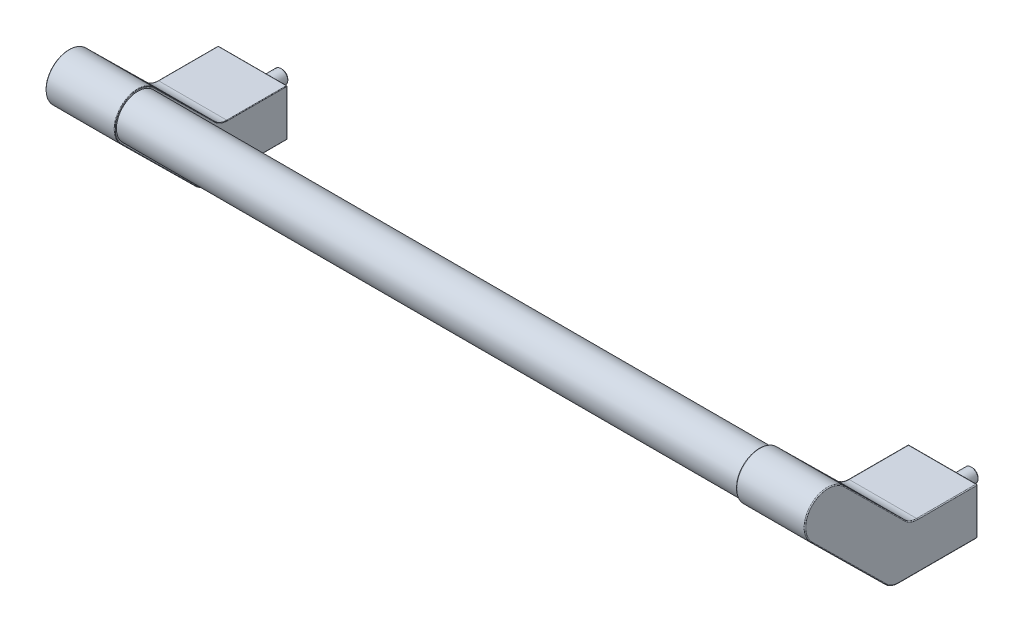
ISO-10303-21;
HEADER;
FILE_DESCRIPTION(('STEP AP214'),'2;1');
FILE_NAME('part.step','',(''),(''),'','','');
FILE_SCHEMA(('AUTOMOTIVE_DESIGN { 1 0 10303 214 1 1 1 1 }'));
ENDSEC;
DATA;
#1=APPLICATION_CONTEXT('core data for automotive mechanical design processes');
#2=APPLICATION_PROTOCOL_DEFINITION('international standard','automotive_design',2000,#1);
#3=PRODUCT_CONTEXT('',#1,'mechanical');
#4=PRODUCT('Part','Part','',(#3));
#5=PRODUCT_RELATED_PRODUCT_CATEGORY('part','',(#4));
#6=PRODUCT_DEFINITION_FORMATION('','',#4);
#7=PRODUCT_DEFINITION_CONTEXT('part definition',#1,'design');
#8=PRODUCT_DEFINITION('design','',#6,#7);
#9=PRODUCT_DEFINITION_SHAPE('','',#8);
#10=(LENGTH_UNIT() NAMED_UNIT(*) SI_UNIT(.MILLI.,.METRE.));
#11=(NAMED_UNIT(*) PLANE_ANGLE_UNIT() SI_UNIT($,.RADIAN.));
#12=(NAMED_UNIT(*) SI_UNIT($,.STERADIAN.) SOLID_ANGLE_UNIT());
#13=UNCERTAINTY_MEASURE_WITH_UNIT(LENGTH_MEASURE(1.E-05),#10,'distance_accuracy_value','');
#14=(GEOMETRIC_REPRESENTATION_CONTEXT(3) GLOBAL_UNCERTAINTY_ASSIGNED_CONTEXT((#13)) GLOBAL_UNIT_ASSIGNED_CONTEXT((#10,
#11,#12)) REPRESENTATION_CONTEXT('',''));
#15=CARTESIAN_POINT('',(0.,0.,0.));
#16=DIRECTION('',(0.,0.,1.));
#17=DIRECTION('',(1.,0.,0.));
#18=AXIS2_PLACEMENT_3D('',#15,#16,#17);
#19=CARTESIAN_POINT('',(0.,0.,52.0000000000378));
#20=DIRECTION('',(0.,0.,1.));
#21=DIRECTION('',(-1.,0.,0.));
#22=AXIS2_PLACEMENT_3D('',#19,#20,#21);
#23=CONICAL_SURFACE('',#22,3.00999999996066,1.04719755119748);
#24=CARTESIAN_POINT('',(0.,0.,50.2621756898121));
#25=VERTEX_POINT('',#24);
#26=VERTEX_LOOP('',#25);
#27=FACE_BOUND('',#26,.T.);
#28=CARTESIAN_POINT('',(0.,0.,52.0000000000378));
#29=DIRECTION('',(0.,0.,1.));
#30=DIRECTION('',(-1.,0.,0.));
#31=AXIS2_PLACEMENT_3D('',#28,#29,#30);
#32=CIRCLE('',#31,3.00999999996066);
#33=CARTESIAN_POINT('',(-1.50499999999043,2.60673646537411,52.0000000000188));
#34=VERTEX_POINT('',#33);
#35=CARTESIAN_POINT('',(-3.00999999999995,0.,52.0000000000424));
#36=VERTEX_POINT('',#35);
#37=EDGE_CURVE('E87',#34,#36,#32,.T.);
#38=ORIENTED_EDGE('',*,*,#37,.T.);
#39=CARTESIAN_POINT('',(0.,0.,52.0000000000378));
#40=DIRECTION('',(0.,0.,1.));
#41=DIRECTION('',(-1.,0.,0.));
#42=AXIS2_PLACEMENT_3D('',#39,#40,#41);
#43=CIRCLE('',#42,3.00999999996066);
#44=CARTESIAN_POINT('',(-1.50499999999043,-2.60673646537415,52.0000000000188));
#45=VERTEX_POINT('',#44);
#46=EDGE_CURVE('E90',#36,#45,#43,.T.);
#47=ORIENTED_EDGE('',*,*,#46,.T.);
#48=CARTESIAN_POINT('',(0.,0.,52.0000000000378));
#49=DIRECTION('',(0.,0.,1.));
#50=DIRECTION('',(-1.,0.,0.));
#51=AXIS2_PLACEMENT_3D('',#48,#49,#50);
#52=CIRCLE('',#51,3.00999999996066);
#53=CARTESIAN_POINT('',(1.50499999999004,-2.60673646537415,52.0000000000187));
#54=VERTEX_POINT('',#53);
#55=EDGE_CURVE('E92',#45,#54,#52,.T.);
#56=ORIENTED_EDGE('',*,*,#55,.T.);
#57=CARTESIAN_POINT('',(0.,0.,52.0000000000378));
#58=DIRECTION('',(0.,0.,1.));
#59=DIRECTION('',(-1.,0.,0.));
#60=AXIS2_PLACEMENT_3D('',#57,#58,#59);
#61=CIRCLE('',#60,3.00999999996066);
#62=CARTESIAN_POINT('',(3.01,6.7952472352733E-13,52.0000000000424));
#63=VERTEX_POINT('',#62);
#64=EDGE_CURVE('E107',#54,#63,#61,.T.);
#65=ORIENTED_EDGE('',*,*,#64,.T.);
#66=CARTESIAN_POINT('',(0.,0.,52.0000000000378));
#67=DIRECTION('',(0.,0.,1.));
#68=DIRECTION('',(-1.,0.,0.));
#69=AXIS2_PLACEMENT_3D('',#66,#67,#68);
#70=CIRCLE('',#69,3.00999999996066);
#71=CARTESIAN_POINT('',(1.50499999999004,2.60673646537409,52.0000000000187));
#72=VERTEX_POINT('',#71);
#73=EDGE_CURVE('E108',#63,#72,#70,.T.);
#74=ORIENTED_EDGE('',*,*,#73,.T.);
#75=CARTESIAN_POINT('',(0.,0.,52.0000000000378));
#76=DIRECTION('',(0.,0.,1.));
#77=DIRECTION('',(-1.,0.,0.));
#78=AXIS2_PLACEMENT_3D('',#75,#76,#77);
#79=CIRCLE('',#78,3.00999999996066);
#80=EDGE_CURVE('E216',#72,#34,#79,.T.);
#81=ORIENTED_EDGE('',*,*,#80,.T.);
#82=EDGE_LOOP('',(#38,#47,#56,#65,#74,#81));
#83=FACE_BOUND('',#82,.T.);
#84=ADVANCED_FACE('F14',(#27,#83),#23,.F.);
#85=CARTESIAN_POINT('',(3.01,-5.21347293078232,52.));
#86=DIRECTION('',(0.,0.,-1.));
#87=DIRECTION('',(1.,0.,0.));
#88=AXIS2_PLACEMENT_3D('',#85,#86,#87);
#89=PLANE('',#88);
#90=DIRECTION('',(-0.866025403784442,-0.499999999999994,0.));
#91=VECTOR('',#90,1.);
#92=CARTESIAN_POINT('',(-3.00999999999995,1.73782431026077,52.));
#93=LINE('',#92,#91);
#94=CARTESIAN_POINT('',(0.,3.47564862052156,52.));
#95=VERTEX_POINT('',#94);
#96=EDGE_CURVE('E166',#34,#95,#93,.F.);
#97=ORIENTED_EDGE('',*,*,#96,.F.);
#98=ORIENTED_EDGE('',*,*,#80,.F.);
#99=DIRECTION('',(-0.866025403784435,0.500000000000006,0.));
#100=VECTOR('',#99,1.);
#101=CARTESIAN_POINT('',(0.,3.47564862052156,52.));
#102=LINE('',#101,#100);
#103=EDGE_CURVE('E152',#95,#72,#102,.F.);
#104=ORIENTED_EDGE('',*,*,#103,.F.);
#105=EDGE_LOOP('',(#97,#98,#104));
#106=FACE_BOUND('',#105,.T.);
#107=ADVANCED_FACE('F297',(#106),#89,.F.);
#108=CARTESIAN_POINT('',(3.01,-5.21347293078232,52.));
#109=DIRECTION('',(0.,0.,-1.));
#110=DIRECTION('',(1.,0.,0.));
#111=AXIS2_PLACEMENT_3D('',#108,#109,#110);
#112=PLANE('',#111);
#113=DIRECTION('',(0.,1.,0.));
#114=VECTOR('',#113,1.);
#115=CARTESIAN_POINT('',(-3.00999999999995,1.73782431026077,52.));
#116=LINE('',#115,#114);
#117=CARTESIAN_POINT('',(-3.00999999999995,1.73782431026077,52.));
#118=VERTEX_POINT('',#117);
#119=EDGE_CURVE('E117',#118,#36,#116,.F.);
#120=ORIENTED_EDGE('',*,*,#119,.T.);
#121=ORIENTED_EDGE('',*,*,#37,.F.);
#122=DIRECTION('',(-0.866025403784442,-0.499999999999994,0.));
#123=VECTOR('',#122,1.);
#124=CARTESIAN_POINT('',(-3.00999999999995,1.73782431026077,52.));
#125=LINE('',#124,#123);
#126=EDGE_CURVE('E170',#118,#34,#125,.F.);
#127=ORIENTED_EDGE('',*,*,#126,.F.);
#128=EDGE_LOOP('',(#120,#121,#127));
#129=FACE_BOUND('',#128,.T.);
#130=ADVANCED_FACE('F302',(#129),#112,.F.);
#131=CARTESIAN_POINT('',(3.01,-5.21347293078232,52.));
#132=DIRECTION('',(0.,0.,-1.));
#133=DIRECTION('',(1.,0.,0.));
#134=AXIS2_PLACEMENT_3D('',#131,#132,#133);
#135=PLANE('',#134);
#136=DIRECTION('',(0.866025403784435,-0.500000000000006,0.));
#137=VECTOR('',#136,1.);
#138=CARTESIAN_POINT('',(0.,-3.47564862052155,52.));
#139=LINE('',#138,#137);
#140=CARTESIAN_POINT('',(-3.00999999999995,-1.73782431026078,52.));
#141=VERTEX_POINT('',#140);
#142=EDGE_CURVE('E111',#45,#141,#139,.F.);
#143=ORIENTED_EDGE('',*,*,#142,.F.);
#144=ORIENTED_EDGE('',*,*,#46,.F.);
#145=DIRECTION('',(0.,1.,0.));
#146=VECTOR('',#145,1.);
#147=CARTESIAN_POINT('',(-3.00999999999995,1.73782431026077,52.));
#148=LINE('',#147,#146);
#149=EDGE_CURVE('E113',#36,#141,#148,.F.);
#150=ORIENTED_EDGE('',*,*,#149,.T.);
#151=EDGE_LOOP('',(#143,#144,#150));
#152=FACE_BOUND('',#151,.T.);
#153=ADVANCED_FACE('F112',(#152),#135,.F.);
#154=CARTESIAN_POINT('',(3.01,-5.21347293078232,52.));
#155=DIRECTION('',(0.,0.,-1.));
#156=DIRECTION('',(1.,0.,0.));
#157=AXIS2_PLACEMENT_3D('',#154,#155,#156);
#158=PLANE('',#157);
#159=DIRECTION('',(-0.866025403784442,-0.499999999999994,0.));
#160=VECTOR('',#159,1.);
#161=CARTESIAN_POINT('',(0.,-3.47564862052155,52.));
#162=LINE('',#161,#160);
#163=CARTESIAN_POINT('',(0.,-3.47564862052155,52.));
#164=VERTEX_POINT('',#163);
#165=EDGE_CURVE('E105',#164,#54,#162,.F.);
#166=ORIENTED_EDGE('',*,*,#165,.T.);
#167=ORIENTED_EDGE('',*,*,#55,.F.);
#168=DIRECTION('',(0.866025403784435,-0.500000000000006,0.));
#169=VECTOR('',#168,1.);
#170=CARTESIAN_POINT('',(0.,-3.47564862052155,52.));
#171=LINE('',#170,#169);
#172=EDGE_CURVE('E102',#164,#45,#171,.F.);
#173=ORIENTED_EDGE('',*,*,#172,.F.);
#174=EDGE_LOOP('',(#166,#167,#173));
#175=FACE_BOUND('',#174,.T.);
#176=ADVANCED_FACE('F100',(#175),#158,.F.);
#177=CARTESIAN_POINT('',(3.01,-5.21347293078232,52.));
#178=DIRECTION('',(0.,0.,-1.));
#179=DIRECTION('',(1.,0.,0.));
#180=AXIS2_PLACEMENT_3D('',#177,#178,#179);
#181=PLANE('',#180);
#182=DIRECTION('',(0.,-1.,0.));
#183=VECTOR('',#182,1.);
#184=CARTESIAN_POINT('',(3.01,-1.73782431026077,52.));
#185=LINE('',#184,#183);
#186=CARTESIAN_POINT('',(3.01,-1.73782431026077,52.));
#187=VERTEX_POINT('',#186);
#188=EDGE_CURVE('E146',#187,#63,#185,.F.);
#189=ORIENTED_EDGE('',*,*,#188,.T.);
#190=ORIENTED_EDGE('',*,*,#64,.F.);
#191=DIRECTION('',(-0.866025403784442,-0.499999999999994,0.));
#192=VECTOR('',#191,1.);
#193=CARTESIAN_POINT('',(0.,-3.47564862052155,52.));
#194=LINE('',#193,#192);
#195=EDGE_CURVE('E258',#54,#187,#194,.F.);
#196=ORIENTED_EDGE('',*,*,#195,.T.);
#197=EDGE_LOOP('',(#189,#190,#196));
#198=FACE_BOUND('',#197,.T.);
#199=ADVANCED_FACE('F315',(#198),#181,.F.);
#200=CARTESIAN_POINT('',(3.01,-5.21347293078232,52.));
#201=DIRECTION('',(0.,0.,-1.));
#202=DIRECTION('',(1.,0.,0.));
#203=AXIS2_PLACEMENT_3D('',#200,#201,#202);
#204=PLANE('',#203);
#205=DIRECTION('',(-0.866025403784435,0.500000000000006,0.));
#206=VECTOR('',#205,1.);
#207=CARTESIAN_POINT('',(0.,3.47564862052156,52.));
#208=LINE('',#207,#206);
#209=CARTESIAN_POINT('',(3.01,1.73782431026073,52.));
#210=VERTEX_POINT('',#209);
#211=EDGE_CURVE('E149',#72,#210,#208,.F.);
#212=ORIENTED_EDGE('',*,*,#211,.F.);
#213=ORIENTED_EDGE('',*,*,#73,.F.);
#214=DIRECTION('',(0.,-1.,0.));
#215=VECTOR('',#214,1.);
#216=CARTESIAN_POINT('',(3.01,-1.73782431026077,52.));
#217=LINE('',#216,#215);
#218=EDGE_CURVE('E143',#63,#210,#217,.F.);
#219=ORIENTED_EDGE('',*,*,#218,.T.);
#220=EDGE_LOOP('',(#212,#213,#219));
#221=FACE_BOUND('',#220,.T.);
#222=ADVANCED_FACE('F292',(#221),#204,.F.);
#223=CARTESIAN_POINT('',(0.,3.47564862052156,52.));
#224=DIRECTION('',(-0.500000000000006,-0.866025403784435,0.));
#225=DIRECTION('',(-0.866025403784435,0.500000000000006,0.));
#226=AXIS2_PLACEMENT_3D('',#223,#224,#225);
#227=PLANE('',#226);
#228=ORIENTED_EDGE('',*,*,#211,.T.);
#229=DIRECTION('',(0.,0.,-1.));
#230=VECTOR('',#229,1.);
#231=CARTESIAN_POINT('',(3.01,1.73782431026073,52.));
#232=LINE('',#231,#230);
#233=CARTESIAN_POINT('',(3.01,1.73782431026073,56.));
#234=VERTEX_POINT('',#233);
#235=EDGE_CURVE('E145',#210,#234,#232,.F.);
#236=ORIENTED_EDGE('',*,*,#235,.T.);
#237=DIRECTION('',(0.866025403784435,-0.500000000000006,0.));
#238=VECTOR('',#237,1.);
#239=CARTESIAN_POINT('',(0.,3.47564862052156,56.));
#240=LINE('',#239,#238);
#241=CARTESIAN_POINT('',(0.,3.47564862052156,56.));
#242=VERTEX_POINT('',#241);
#243=EDGE_CURVE('E173',#242,#234,#240,.T.);
#244=ORIENTED_EDGE('',*,*,#243,.F.);
#245=DIRECTION('',(0.,0.,-1.));
#246=VECTOR('',#245,1.);
#247=CARTESIAN_POINT('',(0.,3.47564862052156,52.));
#248=LINE('',#247,#246);
#249=EDGE_CURVE('E161',#242,#95,#248,.T.);
#250=ORIENTED_EDGE('',*,*,#249,.T.);
#251=ORIENTED_EDGE('',*,*,#103,.T.);
#252=EDGE_LOOP('',(#228,#236,#244,#250,#251));
#253=FACE_BOUND('',#252,.T.);
#254=ADVANCED_FACE('F288',(#253),#227,.T.);
#255=CARTESIAN_POINT('',(-3.00999999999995,1.73782431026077,52.));
#256=DIRECTION('',(0.499999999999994,-0.866025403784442,0.));
#257=DIRECTION('',(-0.866025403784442,-0.499999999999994,0.));
#258=AXIS2_PLACEMENT_3D('',#255,#256,#257);
#259=PLANE('',#258);
#260=ORIENTED_EDGE('',*,*,#96,.T.);
#261=ORIENTED_EDGE('',*,*,#249,.F.);
#262=DIRECTION('',(0.866025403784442,0.499999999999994,0.));
#263=VECTOR('',#262,1.);
#264=CARTESIAN_POINT('',(-3.00999999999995,1.73782431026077,56.));
#265=LINE('',#264,#263);
#266=CARTESIAN_POINT('',(-3.00999999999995,1.73782431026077,56.));
#267=VERTEX_POINT('',#266);
#268=EDGE_CURVE('E176',#267,#242,#265,.T.);
#269=ORIENTED_EDGE('',*,*,#268,.F.);
#270=DIRECTION('',(0.,0.,-1.));
#271=VECTOR('',#270,1.);
#272=CARTESIAN_POINT('',(-3.00999999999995,1.73782431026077,52.));
#273=LINE('',#272,#271);
#274=EDGE_CURVE('E185',#267,#118,#273,.T.);
#275=ORIENTED_EDGE('',*,*,#274,.T.);
#276=ORIENTED_EDGE('',*,*,#126,.T.);
#277=EDGE_LOOP('',(#260,#261,#269,#275,#276));
#278=FACE_BOUND('',#277,.T.);
#279=ADVANCED_FACE('F300',(#278),#259,.T.);
#280=CARTESIAN_POINT('',(-3.00999999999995,1.73782431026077,52.));
#281=DIRECTION('',(-1.,0.,0.));
#282=DIRECTION('',(0.,1.,0.));
#283=AXIS2_PLACEMENT_3D('',#280,#281,#282);
#284=PLANE('',#283);
#285=DIRECTION('',(0.,0.,-1.));
#286=VECTOR('',#285,1.);
#287=CARTESIAN_POINT('',(-3.00999999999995,-1.73782431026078,52.));
#288=LINE('',#287,#286);
#289=CARTESIAN_POINT('',(-3.00999999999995,-1.73782431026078,56.));
#290=VERTEX_POINT('',#289);
#291=EDGE_CURVE('E190',#141,#290,#288,.F.);
#292=ORIENTED_EDGE('',*,*,#291,.F.);
#293=ORIENTED_EDGE('',*,*,#149,.F.);
#294=ORIENTED_EDGE('',*,*,#119,.F.);
#295=ORIENTED_EDGE('',*,*,#274,.F.);
#296=DIRECTION('',(0.,-1.,0.));
#297=VECTOR('',#296,1.);
#298=CARTESIAN_POINT('',(-3.00999999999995,0.,56.));
#299=LINE('',#298,#297);
#300=EDGE_CURVE('E133',#290,#267,#299,.F.);
#301=ORIENTED_EDGE('',*,*,#300,.F.);
#302=EDGE_LOOP('',(#292,#293,#294,#295,#301));
#303=FACE_BOUND('',#302,.T.);
#304=ADVANCED_FACE('F304',(#303),#284,.F.);
#305=CARTESIAN_POINT('',(0.,-3.47564862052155,52.));
#306=DIRECTION('',(0.500000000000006,0.866025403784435,0.));
#307=DIRECTION('',(0.866025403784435,-0.500000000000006,0.));
#308=AXIS2_PLACEMENT_3D('',#305,#306,#307);
#309=PLANE('',#308);
#310=ORIENTED_EDGE('',*,*,#142,.T.);
#311=ORIENTED_EDGE('',*,*,#291,.T.);
#312=DIRECTION('',(-0.866025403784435,0.500000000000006,0.));
#313=VECTOR('',#312,1.);
#314=CARTESIAN_POINT('',(0.,-3.47564862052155,56.));
#315=LINE('',#314,#313);
#316=CARTESIAN_POINT('',(0.,-3.47564862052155,56.));
#317=VERTEX_POINT('',#316);
#318=EDGE_CURVE('E130',#317,#290,#315,.T.);
#319=ORIENTED_EDGE('',*,*,#318,.F.);
#320=DIRECTION('',(0.,0.,-1.));
#321=VECTOR('',#320,1.);
#322=CARTESIAN_POINT('',(0.,-3.47564862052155,52.));
#323=LINE('',#322,#321);
#324=EDGE_CURVE('E121',#317,#164,#323,.T.);
#325=ORIENTED_EDGE('',*,*,#324,.T.);
#326=ORIENTED_EDGE('',*,*,#172,.T.);
#327=EDGE_LOOP('',(#310,#311,#319,#325,#326));
#328=FACE_BOUND('',#327,.T.);
#329=ADVANCED_FACE('F119',(#328),#309,.T.);
#330=CARTESIAN_POINT('',(0.,-3.47564862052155,52.));
#331=DIRECTION('',(0.499999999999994,-0.866025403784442,0.));
#332=DIRECTION('',(-0.866025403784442,-0.499999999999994,0.));
#333=AXIS2_PLACEMENT_3D('',#330,#331,#332);
#334=PLANE('',#333);
#335=DIRECTION('',(0.,0.,-1.));
#336=VECTOR('',#335,1.);
#337=CARTESIAN_POINT('',(3.01,-1.73782431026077,52.));
#338=LINE('',#337,#336);
#339=CARTESIAN_POINT('',(3.01,-1.73782431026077,56.));
#340=VERTEX_POINT('',#339);
#341=EDGE_CURVE('E134',#187,#340,#338,.F.);
#342=ORIENTED_EDGE('',*,*,#341,.F.);
#343=ORIENTED_EDGE('',*,*,#195,.F.);
#344=ORIENTED_EDGE('',*,*,#165,.F.);
#345=ORIENTED_EDGE('',*,*,#324,.F.);
#346=DIRECTION('',(-0.866025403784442,-0.499999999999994,0.));
#347=VECTOR('',#346,1.);
#348=CARTESIAN_POINT('',(3.01,-1.73782431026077,56.));
#349=LINE('',#348,#347);
#350=EDGE_CURVE('E137',#340,#317,#349,.T.);
#351=ORIENTED_EDGE('',*,*,#350,.F.);
#352=EDGE_LOOP('',(#342,#343,#344,#345,#351));
#353=FACE_BOUND('',#352,.T.);
#354=ADVANCED_FACE('F283',(#353),#334,.F.);
#355=CARTESIAN_POINT('',(3.01,-1.73782431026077,52.));
#356=DIRECTION('',(1.,0.,0.));
#357=DIRECTION('',(0.,-1.,0.));
#358=AXIS2_PLACEMENT_3D('',#355,#356,#357);
#359=PLANE('',#358);
#360=ORIENTED_EDGE('',*,*,#235,.F.);
#361=ORIENTED_EDGE('',*,*,#218,.F.);
#362=ORIENTED_EDGE('',*,*,#188,.F.);
#363=ORIENTED_EDGE('',*,*,#341,.T.);
#364=DIRECTION('',(0.,-1.,0.));
#365=VECTOR('',#364,1.);
#366=CARTESIAN_POINT('',(3.01,0.,56.));
#367=LINE('',#366,#365);
#368=EDGE_CURVE('E140',#234,#340,#367,.T.);
#369=ORIENTED_EDGE('',*,*,#368,.F.);
#370=EDGE_LOOP('',(#360,#361,#362,#363,#369));
#371=FACE_BOUND('',#370,.T.);
#372=ADVANCED_FACE('F277',(#371),#359,.F.);
#373=CARTESIAN_POINT('',(0.,0.,56.));
#374=DIRECTION('',(0.,0.,1.));
#375=DIRECTION('',(-1.,0.,0.));
#376=AXIS2_PLACEMENT_3D('',#373,#374,#375);
#377=PLANE('',#376);
#378=CARTESIAN_POINT('',(0.,0.,56.));
#379=DIRECTION('',(0.,0.,-1.));
#380=DIRECTION('',(1.,0.,0.));
#381=AXIS2_PLACEMENT_3D('',#378,#379,#380);
#382=CIRCLE('',#381,5.7);
#383=CARTESIAN_POINT('',(5.7,0.,56.));
#384=VERTEX_POINT('',#383);
#385=CARTESIAN_POINT('',(-5.7,0.,56.));
#386=VERTEX_POINT('',#385);
#387=EDGE_CURVE('E30',#384,#386,#382,.T.);
#388=ORIENTED_EDGE('',*,*,#387,.F.);
#389=CARTESIAN_POINT('',(0.,0.,56.));
#390=DIRECTION('',(0.,0.,-1.));
#391=DIRECTION('',(-1.,0.,0.));
#392=AXIS2_PLACEMENT_3D('',#389,#390,#391);
#393=CIRCLE('',#392,5.7);
#394=EDGE_CURVE('E248',#386,#384,#393,.T.);
#395=ORIENTED_EDGE('',*,*,#394,.F.);
#396=EDGE_LOOP('',(#388,#395));
#397=FACE_BOUND('',#396,.T.);
#398=ORIENTED_EDGE('',*,*,#368,.T.);
#399=ORIENTED_EDGE('',*,*,#350,.T.);
#400=ORIENTED_EDGE('',*,*,#318,.T.);
#401=ORIENTED_EDGE('',*,*,#300,.T.);
#402=ORIENTED_EDGE('',*,*,#268,.T.);
#403=ORIENTED_EDGE('',*,*,#243,.T.);
#404=EDGE_LOOP('',(#398,#399,#400,#401,#402,#403));
#405=FACE_BOUND('',#404,.T.);
#406=ADVANCED_FACE('F233',(#397,#405),#377,.T.);
#407=CARTESIAN_POINT('',(0.,0.,55.2));
#408=DIRECTION('',(0.,0.,1.));
#409=DIRECTION('',(-1.,0.,0.));
#410=AXIS2_PLACEMENT_3D('',#407,#408,#409);
#411=TOROIDAL_SURFACE('',#410,5.7,0.8);
#412=CARTESIAN_POINT('',(0.,0.,55.2));
#413=DIRECTION('',(0.,0.,1.));
#414=DIRECTION('',(-1.,0.,0.));
#415=AXIS2_PLACEMENT_3D('',#412,#413,#414);
#416=CIRCLE('',#415,6.5);
#417=CARTESIAN_POINT('',(-6.5,0.,55.2));
#418=VERTEX_POINT('',#417);
#419=EDGE_CURVE('E213',#418,#418,#416,.F.);
#420=ORIENTED_EDGE('',*,*,#419,.F.);
#421=EDGE_LOOP('',(#420));
#422=FACE_BOUND('',#421,.T.);
#423=ORIENTED_EDGE('',*,*,#394,.T.);
#424=ORIENTED_EDGE('',*,*,#387,.T.);
#425=EDGE_LOOP('',(#423,#424));
#426=FACE_BOUND('',#425,.T.);
#427=ADVANCED_FACE('F221',(#422,#426),#411,.T.);
#428=CARTESIAN_POINT('',(0.,0.,87.75));
#429=DIRECTION('',(0.,0.,1.));
#430=DIRECTION('',(-1.,0.,0.));
#431=AXIS2_PLACEMENT_3D('',#428,#429,#430);
#432=CYLINDRICAL_SURFACE('',#431,6.5);
#433=CARTESIAN_POINT('',(0.,0.,48.));
#434=DIRECTION('',(0.,0.,1.));
#435=DIRECTION('',(-1.,0.,0.));
#436=AXIS2_PLACEMENT_3D('',#433,#434,#435);
#437=CIRCLE('',#436,6.5);
#438=CARTESIAN_POINT('',(-6.5,0.,48.));
#439=VERTEX_POINT('',#438);
#440=EDGE_CURVE('E211',#439,#439,#437,.F.);
#441=ORIENTED_EDGE('',*,*,#440,.F.);
#442=EDGE_LOOP('',(#441));
#443=FACE_BOUND('',#442,.T.);
#444=ORIENTED_EDGE('',*,*,#419,.T.);
#445=EDGE_LOOP('',(#444));
#446=FACE_BOUND('',#445,.T.);
#447=ADVANCED_FACE('F232',(#443,#446),#432,.T.);
#448=CARTESIAN_POINT('',(-19.7,13.2,0.3));
#449=DIRECTION('',(0.,1.,0.));
#450=DIRECTION('',(-1.,0.,0.));
#451=AXIS2_PLACEMENT_3D('',#448,#449,#450);
#452=SPHERICAL_SURFACE('',#451,0.3);
#453=CARTESIAN_POINT('',(-19.7,13.2,0.3));
#454=DIRECTION('',(0.,0.,1.));
#455=DIRECTION('',(1.,0.,0.));
#456=AXIS2_PLACEMENT_3D('',#453,#454,#455);
#457=CIRCLE('',#456,0.3);
#458=CARTESIAN_POINT('',(-19.7,13.5,0.3));
#459=VERTEX_POINT('',#458);
#460=CARTESIAN_POINT('',(-20.,13.2,0.299999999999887));
#461=VERTEX_POINT('',#460);
#462=EDGE_CURVE('E2243',#459,#461,#457,.T.);
#463=ORIENTED_EDGE('',*,*,#462,.F.);
#464=CARTESIAN_POINT('',(-19.7,13.2,0.3));
#465=DIRECTION('',(-1.,0.,0.));
#466=DIRECTION('',(0.,-1.,0.));
#467=AXIS2_PLACEMENT_3D('',#464,#465,#466);
#468=CIRCLE('',#467,0.3);
#469=CARTESIAN_POINT('',(-19.7,13.2,0.));
#470=VERTEX_POINT('',#469);
#471=EDGE_CURVE('E2359',#470,#459,#468,.F.);
#472=ORIENTED_EDGE('',*,*,#471,.F.);
#473=CARTESIAN_POINT('',(-19.7,13.2,0.3));
#474=DIRECTION('',(0.,1.,0.));
#475=DIRECTION('',(-1.,0.,0.));
#476=AXIS2_PLACEMENT_3D('',#473,#474,#475);
#477=CIRCLE('',#476,0.3);
#478=EDGE_CURVE('E2273',#461,#470,#477,.F.);
#479=ORIENTED_EDGE('',*,*,#478,.F.);
#480=EDGE_LOOP('',(#463,#472,#479));
#481=FACE_BOUND('',#480,.T.);
#482=ADVANCED_FACE('F427',(#481),#452,.T.);
#483=CARTESIAN_POINT('',(-19.7,-13.2,0.3));
#484=DIRECTION('',(0.,1.,0.));
#485=DIRECTION('',(-1.,0.,0.));
#486=AXIS2_PLACEMENT_3D('',#483,#484,#485);
#487=SPHERICAL_SURFACE('',#486,0.3);
#488=CARTESIAN_POINT('',(-19.7,-13.2,0.3));
#489=DIRECTION('',(0.,0.,-1.));
#490=DIRECTION('',(-1.,0.,0.));
#491=AXIS2_PLACEMENT_3D('',#488,#489,#490);
#492=CIRCLE('',#491,0.3);
#493=CARTESIAN_POINT('',(-20.,-13.2,0.299999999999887));
#494=VERTEX_POINT('',#493);
#495=CARTESIAN_POINT('',(-19.7,-13.5,0.3));
#496=VERTEX_POINT('',#495);
#497=EDGE_CURVE('E2293',#494,#496,#492,.F.);
#498=ORIENTED_EDGE('',*,*,#497,.F.);
#499=CARTESIAN_POINT('',(-19.7,-13.2,0.3));
#500=DIRECTION('',(0.,1.,0.));
#501=DIRECTION('',(-1.,0.,0.));
#502=AXIS2_PLACEMENT_3D('',#499,#500,#501);
#503=CIRCLE('',#502,0.3);
#504=CARTESIAN_POINT('',(-19.7,-13.2,0.));
#505=VERTEX_POINT('',#504);
#506=EDGE_CURVE('E2292',#505,#494,#503,.T.);
#507=ORIENTED_EDGE('',*,*,#506,.F.);
#508=CARTESIAN_POINT('',(-19.7,-13.2,0.3));
#509=DIRECTION('',(-1.,0.,0.));
#510=DIRECTION('',(0.,1.,0.));
#511=AXIS2_PLACEMENT_3D('',#508,#509,#510);
#512=CIRCLE('',#511,0.3);
#513=EDGE_CURVE('E2267',#505,#496,#512,.T.);
#514=ORIENTED_EDGE('',*,*,#513,.T.);
#515=EDGE_LOOP('',(#498,#507,#514));
#516=FACE_BOUND('',#515,.T.);
#517=ADVANCED_FACE('F435',(#516),#487,.T.);
#518=CARTESIAN_POINT('',(0.,0.,48.));
#519=DIRECTION('',(0.,0.,-1.));
#520=DIRECTION('',(-1.,0.,0.));
#521=AXIS2_PLACEMENT_3D('',#518,#519,#520);
#522=PLANE('',#521);
#523=CARTESIAN_POINT('',(0.,0.,48.));
#524=DIRECTION('',(0.,0.,-1.));
#525=DIRECTION('',(-1.,0.,0.));
#526=AXIS2_PLACEMENT_3D('',#523,#524,#525);
#527=CIRCLE('',#526,7.5);
#528=CARTESIAN_POINT('',(-7.5,0.,48.));
#529=VERTEX_POINT('',#528);
#530=EDGE_CURVE('E2143',#529,#529,#527,.F.);
#531=ORIENTED_EDGE('',*,*,#530,.T.);
#532=EDGE_LOOP('',(#531));
#533=FACE_BOUND('',#532,.T.);
#534=ORIENTED_EDGE('',*,*,#440,.T.);
#535=EDGE_LOOP('',(#534));
#536=FACE_BOUND('',#535,.T.);
#537=ADVANCED_FACE('F446',(#533,#536),#522,.F.);
#538=CARTESIAN_POINT('',(-20.,41.5,86.5));
#539=DIRECTION('',(1.,0.,0.));
#540=DIRECTION('',(0.,1.,0.));
#541=AXIS2_PLACEMENT_3D('',#538,#539,#540);
#542=PLANE('',#541);
#543=DIRECTION('',(0.,1.,0.));
#544=VECTOR('',#543,1.);
#545=CARTESIAN_POINT('',(-20.,41.5,0.299999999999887));
#546=LINE('',#545,#544);
#547=EDGE_CURVE('E2468',#494,#461,#546,.T.);
#548=ORIENTED_EDGE('',*,*,#547,.F.);
#549=DIRECTION('',(0.,0.,1.));
#550=VECTOR('',#549,1.);
#551=CARTESIAN_POINT('',(-20.,-13.2,86.5));
#552=LINE('',#551,#550);
#553=CARTESIAN_POINT('',(-20.,-13.2,45.8957313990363));
#554=VERTEX_POINT('',#553);
#555=EDGE_CURVE('E2471',#554,#494,#552,.F.);
#556=ORIENTED_EDGE('',*,*,#555,.F.);
#557=CARTESIAN_POINT('',(-20.,-3.5,45.8957313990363));
#558=DIRECTION('',(1.,0.,0.));
#559=DIRECTION('',(0.,-0.711669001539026,0.702514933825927));
#560=AXIS2_PLACEMENT_3D('',#557,#558,#559);
#561=CIRCLE('',#560,9.7);
#562=CARTESIAN_POINT('',(-20.,-10.4031893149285,52.7101262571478));
#563=VERTEX_POINT('',#562);
#564=EDGE_CURVE('E2452',#563,#554,#561,.T.);
#565=ORIENTED_EDGE('',*,*,#564,.F.);
#566=DIRECTION('',(0.,-0.702514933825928,-0.711669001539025));
#567=VECTOR('',#566,1.);
#568=CARTESIAN_POINT('',(-20.,32.1059691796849,95.7731971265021));
#569=LINE('',#568,#567);
#570=CARTESIAN_POINT('',(-20.,32.1059691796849,95.7731971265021));
#571=VERTEX_POINT('',#570);
#572=EDGE_CURVE('E2486',#571,#563,#569,.T.);
#573=ORIENTED_EDGE('',*,*,#572,.F.);
#574=CARTESIAN_POINT('',(-20.,41.5,86.5));
#575=DIRECTION('',(1.,0.,0.));
#576=DIRECTION('',(0.,1.,0.));
#577=AXIS2_PLACEMENT_3D('',#574,#575,#576);
#578=CIRCLE('',#577,13.2);
#579=CARTESIAN_POINT('',(-20.,54.7,86.5));
#580=VERTEX_POINT('',#579);
#581=EDGE_CURVE('E2206',#580,#571,#578,.T.);
#582=ORIENTED_EDGE('',*,*,#581,.F.);
#583=CARTESIAN_POINT('',(-20.,41.5,86.5));
#584=DIRECTION('',(1.,0.,0.));
#585=DIRECTION('',(0.,0.711669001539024,-0.702514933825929));
#586=AXIS2_PLACEMENT_3D('',#583,#584,#585);
#587=CIRCLE('',#586,13.2);
#588=CARTESIAN_POINT('',(-20.,50.8940308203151,77.2268028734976));
#589=VERTEX_POINT('',#588);
#590=EDGE_CURVE('E2161',#589,#580,#587,.T.);
#591=ORIENTED_EDGE('',*,*,#590,.F.);
#592=DIRECTION('',(0.,0.702514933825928,0.711669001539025));
#593=VECTOR('',#592,1.);
#594=CARTESIAN_POINT('',(-20.,16.169809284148,42.0501099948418));
#595=LINE('',#594,#593);
#596=CARTESIAN_POINT('',(-20.,16.169809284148,42.0501099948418));
#597=VERTEX_POINT('',#596);
#598=EDGE_CURVE('E2481',#597,#589,#595,.T.);
#599=ORIENTED_EDGE('',*,*,#598,.F.);
#600=CARTESIAN_POINT('',(-20.,23.5,34.8142061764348));
#601=DIRECTION('',(-1.,0.,0.));
#602=DIRECTION('',(0.,-1.,0.));
#603=AXIS2_PLACEMENT_3D('',#600,#601,#602);
#604=CIRCLE('',#603,10.3);
#605=CARTESIAN_POINT('',(-20.,13.2,34.8142061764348));
#606=VERTEX_POINT('',#605);
#607=EDGE_CURVE('E2229',#606,#597,#604,.T.);
#608=ORIENTED_EDGE('',*,*,#607,.F.);
#609=DIRECTION('',(0.,0.,1.));
#610=VECTOR('',#609,1.);
#611=CARTESIAN_POINT('',(-20.,13.2,86.5));
#612=LINE('',#611,#610);
#613=EDGE_CURVE('E97',#461,#606,#612,.T.);
#614=ORIENTED_EDGE('',*,*,#613,.F.);
#615=EDGE_LOOP('',(#548,#556,#565,#573,#582,#591,#599,#608,#614));
#616=FACE_BOUND('',#615,.T.);
#617=ADVANCED_FACE('F457',(#616),#542,.F.);
#618=CARTESIAN_POINT('',(-19.7,41.5,86.5));
#619=DIRECTION('',(1.,0.,0.));
#620=DIRECTION('',(0.,1.,0.));
#621=AXIS2_PLACEMENT_3D('',#618,#619,#620);
#622=TOROIDAL_SURFACE('',#621,13.2,0.3);
#623=CARTESIAN_POINT('',(-19.7,32.1059691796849,95.7731971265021));
#624=DIRECTION('',(0.,-0.702514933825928,-0.711669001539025));
#625=DIRECTION('',(0.,0.711669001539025,-0.702514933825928));
#626=AXIS2_PLACEMENT_3D('',#623,#624,#625);
#627=CIRCLE('',#626,0.3);
#628=CARTESIAN_POINT('',(-19.7,31.8924684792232,95.98395160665));
#629=VERTEX_POINT('',#628);
#630=EDGE_CURVE('E2198',#629,#571,#627,.T.);
#631=ORIENTED_EDGE('',*,*,#630,.F.);
#632=CARTESIAN_POINT('',(-19.7,41.5,86.5));
#633=DIRECTION('',(1.,0.,0.));
#634=DIRECTION('',(0.,1.,0.));
#635=AXIS2_PLACEMENT_3D('',#632,#633,#634);
#636=CIRCLE('',#635,13.5);
#637=CARTESIAN_POINT('',(-19.7,51.1075315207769,77.0160483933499));
#638=VERTEX_POINT('',#637);
#639=EDGE_CURVE('E2217',#629,#638,#636,.F.);
#640=ORIENTED_EDGE('',*,*,#639,.T.);
#641=CARTESIAN_POINT('',(-19.7,50.8940308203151,77.2268028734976));
#642=DIRECTION('',(0.,0.702514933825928,0.711669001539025));
#643=DIRECTION('',(0.,0.711669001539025,-0.702514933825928));
#644=AXIS2_PLACEMENT_3D('',#641,#642,#643);
#645=CIRCLE('',#644,0.3);
#646=EDGE_CURVE('E2210',#638,#589,#645,.T.);
#647=ORIENTED_EDGE('',*,*,#646,.T.);
#648=ORIENTED_EDGE('',*,*,#590,.T.);
#649=ORIENTED_EDGE('',*,*,#581,.T.);
#650=EDGE_LOOP('',(#631,#640,#647,#648,#649));
#651=FACE_BOUND('',#650,.T.);
#652=ADVANCED_FACE('F466',(#651),#622,.T.);
#653=CARTESIAN_POINT('',(-19.7,13.2864992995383,39.1292292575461));
#654=DIRECTION('',(0.,0.702514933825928,0.711669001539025));
#655=DIRECTION('',(0.,-0.711669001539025,0.702514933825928));
#656=AXIS2_PLACEMENT_3D('',#653,#654,#655);
#657=CYLINDRICAL_SURFACE('',#656,0.3);
#658=CARTESIAN_POINT('',(-19.7,16.169809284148,42.0501099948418));
#659=DIRECTION('',(0.,0.702514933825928,0.711669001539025));
#660=DIRECTION('',(0.,-0.711669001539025,0.702514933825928));
#661=AXIS2_PLACEMENT_3D('',#658,#659,#660);
#662=CIRCLE('',#661,0.3);
#663=CARTESIAN_POINT('',(-19.7,16.3833099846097,41.8393555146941));
#664=VERTEX_POINT('',#663);
#665=EDGE_CURVE('E2218',#664,#597,#662,.T.);
#666=ORIENTED_EDGE('',*,*,#665,.T.);
#667=ORIENTED_EDGE('',*,*,#598,.T.);
#668=ORIENTED_EDGE('',*,*,#646,.F.);
#669=DIRECTION('',(0.,0.702514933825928,0.711669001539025));
#670=VECTOR('',#669,1.);
#671=CARTESIAN_POINT('',(-19.7,13.5,38.9184747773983));
#672=LINE('',#671,#670);
#673=EDGE_CURVE('E2222',#638,#664,#672,.F.);
#674=ORIENTED_EDGE('',*,*,#673,.T.);
#675=EDGE_LOOP('',(#666,#667,#668,#674));
#676=FACE_BOUND('',#675,.T.);
#677=ADVANCED_FACE('F475',(#676),#657,.T.);
#678=CARTESIAN_POINT('',(-19.7,23.5,34.8142061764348));
#679=DIRECTION('',(1.,0.,0.));
#680=DIRECTION('',(0.,1.,0.));
#681=AXIS2_PLACEMENT_3D('',#678,#679,#680);
#682=TOROIDAL_SURFACE('',#681,10.3,0.3);
#683=CARTESIAN_POINT('',(-19.7,13.2,34.8142061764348));
#684=DIRECTION('',(0.,0.,1.));
#685=DIRECTION('',(1.,0.,0.));
#686=AXIS2_PLACEMENT_3D('',#683,#684,#685);
#687=CIRCLE('',#686,0.3);
#688=CARTESIAN_POINT('',(-19.7,13.5,34.8142061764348));
#689=VERTEX_POINT('',#688);
#690=EDGE_CURVE('E2244',#606,#689,#687,.F.);
#691=ORIENTED_EDGE('',*,*,#690,.F.);
#692=ORIENTED_EDGE('',*,*,#607,.T.);
#693=ORIENTED_EDGE('',*,*,#665,.F.);
#694=CARTESIAN_POINT('',(-19.7,23.5,34.8142061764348));
#695=DIRECTION('',(1.,0.,0.));
#696=DIRECTION('',(0.,1.,0.));
#697=AXIS2_PLACEMENT_3D('',#694,#695,#696);
#698=CIRCLE('',#697,10.);
#699=EDGE_CURVE('E2257',#664,#689,#698,.T.);
#700=ORIENTED_EDGE('',*,*,#699,.T.);
#701=EDGE_LOOP('',(#691,#692,#693,#700));
#702=FACE_BOUND('',#701,.T.);
#703=ADVANCED_FACE('F438',(#702),#682,.T.);
#704=CARTESIAN_POINT('',(-19.7,13.2,0.));
#705=DIRECTION('',(0.,0.,1.));
#706=DIRECTION('',(1.,0.,0.));
#707=AXIS2_PLACEMENT_3D('',#704,#705,#706);
#708=CYLINDRICAL_SURFACE('',#707,0.3);
#709=ORIENTED_EDGE('',*,*,#462,.T.);
#710=ORIENTED_EDGE('',*,*,#613,.T.);
#711=ORIENTED_EDGE('',*,*,#690,.T.);
#712=DIRECTION('',(0.,0.,1.));
#713=VECTOR('',#712,1.);
#714=CARTESIAN_POINT('',(-19.7,13.5,0.));
#715=LINE('',#714,#713);
#716=EDGE_CURVE('E2233',#689,#459,#715,.F.);
#717=ORIENTED_EDGE('',*,*,#716,.T.);
#718=EDGE_LOOP('',(#709,#710,#711,#717));
#719=FACE_BOUND('',#718,.T.);
#720=ADVANCED_FACE('F468',(#719),#708,.T.);
#721=CARTESIAN_POINT('',(-19.7,-13.5,0.3));
#722=DIRECTION('',(0.,1.,0.));
#723=DIRECTION('',(-1.,0.,0.));
#724=AXIS2_PLACEMENT_3D('',#721,#722,#723);
#725=CYLINDRICAL_SURFACE('',#724,0.3);
#726=ORIENTED_EDGE('',*,*,#478,.T.);
#727=DIRECTION('',(0.,1.,0.));
#728=VECTOR('',#727,1.);
#729=CARTESIAN_POINT('',(-19.7,-13.5,0.));
#730=LINE('',#729,#728);
#731=EDGE_CURVE('E2270',#470,#505,#730,.F.);
#732=ORIENTED_EDGE('',*,*,#731,.T.);
#733=ORIENTED_EDGE('',*,*,#506,.T.);
#734=ORIENTED_EDGE('',*,*,#547,.T.);
#735=EDGE_LOOP('',(#726,#732,#733,#734));
#736=FACE_BOUND('',#735,.T.);
#737=ADVANCED_FACE('F501',(#736),#725,.T.);
#738=CARTESIAN_POINT('',(20.,13.2,0.299999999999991));
#739=DIRECTION('',(-1.,0.,0.));
#740=DIRECTION('',(0.,-1.,0.));
#741=AXIS2_PLACEMENT_3D('',#738,#739,#740);
#742=CYLINDRICAL_SURFACE('',#741,0.3);
#743=CARTESIAN_POINT('',(19.7,13.2,0.299999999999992));
#744=DIRECTION('',(-1.,0.,0.));
#745=DIRECTION('',(0.,-1.,0.));
#746=AXIS2_PLACEMENT_3D('',#743,#744,#745);
#747=CIRCLE('',#746,0.3);
#748=CARTESIAN_POINT('',(19.7,13.5,0.299999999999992));
#749=VERTEX_POINT('',#748);
#750=CARTESIAN_POINT('',(19.7,13.2,0.));
#751=VERTEX_POINT('',#750);
#752=EDGE_CURVE('E2356',#749,#751,#747,.T.);
#753=ORIENTED_EDGE('',*,*,#752,.T.);
#754=DIRECTION('',(1.,0.,0.));
#755=VECTOR('',#754,1.);
#756=CARTESIAN_POINT('',(20.,13.2,0.));
#757=LINE('',#756,#755);
#758=EDGE_CURVE('E2263',#751,#470,#757,.F.);
#759=ORIENTED_EDGE('',*,*,#758,.T.);
#760=ORIENTED_EDGE('',*,*,#471,.T.);
#761=DIRECTION('',(1.,0.,0.));
#762=VECTOR('',#761,1.);
#763=CARTESIAN_POINT('',(20.,13.5,0.299999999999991));
#764=LINE('',#763,#762);
#765=EDGE_CURVE('E2247',#459,#749,#764,.T.);
#766=ORIENTED_EDGE('',*,*,#765,.T.);
#767=EDGE_LOOP('',(#753,#759,#760,#766));
#768=FACE_BOUND('',#767,.T.);
#769=ADVANCED_FACE('F510',(#768),#742,.T.);
#770=CARTESIAN_POINT('',(-19.7,-13.2,0.));
#771=DIRECTION('',(0.,0.,-1.));
#772=DIRECTION('',(-1.,0.,0.));
#773=AXIS2_PLACEMENT_3D('',#770,#771,#772);
#774=CYLINDRICAL_SURFACE('',#773,0.3);
#775=ORIENTED_EDGE('',*,*,#497,.T.);
#776=DIRECTION('',(0.,0.,-1.));
#777=VECTOR('',#776,1.);
#778=CARTESIAN_POINT('',(-19.7,-13.5,0.));
#779=LINE('',#778,#777);
#780=CARTESIAN_POINT('',(-19.7,-13.5,45.8957313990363));
#781=VERTEX_POINT('',#780);
#782=EDGE_CURVE('E2289',#496,#781,#779,.F.);
#783=ORIENTED_EDGE('',*,*,#782,.T.);
#784=CARTESIAN_POINT('',(-19.7,-13.2,45.8957313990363));
#785=DIRECTION('',(0.,0.,-1.));
#786=DIRECTION('',(-1.,0.,0.));
#787=AXIS2_PLACEMENT_3D('',#784,#785,#786);
#788=CIRCLE('',#787,0.3);
#789=EDGE_CURVE('E2298',#781,#554,#788,.T.);
#790=ORIENTED_EDGE('',*,*,#789,.T.);
#791=ORIENTED_EDGE('',*,*,#555,.T.);
#792=EDGE_LOOP('',(#775,#783,#790,#791));
#793=FACE_BOUND('',#792,.T.);
#794=ADVANCED_FACE('F513',(#793),#774,.T.);
#795=CARTESIAN_POINT('',(20.,-13.2,0.299999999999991));
#796=DIRECTION('',(-1.,0.,0.));
#797=DIRECTION('',(0.,-1.,0.));
#798=AXIS2_PLACEMENT_3D('',#795,#796,#797);
#799=CYLINDRICAL_SURFACE('',#798,0.3);
#800=CARTESIAN_POINT('',(19.7,-13.2,0.299999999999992));
#801=DIRECTION('',(-1.,0.,0.));
#802=DIRECTION('',(0.,-1.,0.));
#803=AXIS2_PLACEMENT_3D('',#800,#801,#802);
#804=CIRCLE('',#803,0.3);
#805=CARTESIAN_POINT('',(19.7,-13.2,0.));
#806=VERTEX_POINT('',#805);
#807=CARTESIAN_POINT('',(19.7,-13.5,0.299999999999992));
#808=VERTEX_POINT('',#807);
#809=EDGE_CURVE('E2367',#806,#808,#804,.T.);
#810=ORIENTED_EDGE('',*,*,#809,.T.);
#811=DIRECTION('',(-1.,0.,0.));
#812=VECTOR('',#811,1.);
#813=CARTESIAN_POINT('',(20.,-13.5,0.299999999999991));
#814=LINE('',#813,#812);
#815=EDGE_CURVE('E2277',#808,#496,#814,.T.);
#816=ORIENTED_EDGE('',*,*,#815,.T.);
#817=ORIENTED_EDGE('',*,*,#513,.F.);
#818=DIRECTION('',(1.,0.,0.));
#819=VECTOR('',#818,1.);
#820=CARTESIAN_POINT('',(20.,-13.2,0.));
#821=LINE('',#820,#819);
#822=EDGE_CURVE('E2266',#505,#806,#821,.T.);
#823=ORIENTED_EDGE('',*,*,#822,.T.);
#824=EDGE_LOOP('',(#810,#816,#817,#823));
#825=FACE_BOUND('',#824,.T.);
#826=ADVANCED_FACE('F530',(#825),#799,.T.);
#827=CARTESIAN_POINT('',(-19.7,-3.5,45.8957313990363));
#828=DIRECTION('',(1.,0.,0.));
#829=DIRECTION('',(0.,1.,0.));
#830=AXIS2_PLACEMENT_3D('',#827,#828,#829);
#831=TOROIDAL_SURFACE('',#830,9.7,0.3);
#832=ORIENTED_EDGE('',*,*,#789,.F.);
#833=CARTESIAN_POINT('',(-19.7,-3.5,45.8957313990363));
#834=DIRECTION('',(1.,0.,0.));
#835=DIRECTION('',(0.,1.,0.));
#836=AXIS2_PLACEMENT_3D('',#833,#834,#835);
#837=CIRCLE('',#836,10.);
#838=CARTESIAN_POINT('',(-19.7,-10.6166900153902,52.9208807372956));
#839=VERTEX_POINT('',#838);
#840=EDGE_CURVE('E2197',#781,#839,#837,.F.);
#841=ORIENTED_EDGE('',*,*,#840,.T.);
#842=CARTESIAN_POINT('',(-19.7,-10.4031893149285,52.7101262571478));
#843=DIRECTION('',(0.,-0.702514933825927,-0.711669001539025));
#844=DIRECTION('',(0.,-0.711669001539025,0.702514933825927));
#845=AXIS2_PLACEMENT_3D('',#842,#843,#844);
#846=CIRCLE('',#845,0.3);
#847=EDGE_CURVE('E2190',#839,#563,#846,.T.);
#848=ORIENTED_EDGE('',*,*,#847,.T.);
#849=ORIENTED_EDGE('',*,*,#564,.T.);
#850=EDGE_LOOP('',(#832,#841,#848,#849));
#851=FACE_BOUND('',#850,.T.);
#852=ADVANCED_FACE('F533',(#851),#831,.T.);
#853=CARTESIAN_POINT('',(0.,0.,100.));
#854=DIRECTION('',(0.,0.,-1.));
#855=DIRECTION('',(-1.,0.,0.));
#856=AXIS2_PLACEMENT_3D('',#853,#854,#855);
#857=CYLINDRICAL_SURFACE('',#856,7.5);
#858=CARTESIAN_POINT('',(0.,0.,63.6759107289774));
#859=DIRECTION('',(0.,0.711669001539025,-0.702514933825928));
#860=DIRECTION('',(0.,-0.702514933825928,-0.711669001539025));
#861=AXIS2_PLACEMENT_3D('',#858,#859,#860);
#862=ELLIPSE('',#861,10.6759296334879,7.5);
#863=CARTESIAN_POINT('',(0.,-7.5,56.0781825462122));
#864=VERTEX_POINT('',#863);
#865=EDGE_CURVE('E2156',#864,#864,#862,.F.);
#866=ORIENTED_EDGE('',*,*,#865,.T.);
#867=EDGE_LOOP('',(#866));
#868=FACE_BOUND('',#867,.T.);
#869=ORIENTED_EDGE('',*,*,#530,.F.);
#870=EDGE_LOOP('',(#869));
#871=FACE_BOUND('',#870,.T.);
#872=ADVANCED_FACE('F549',(#868,#871),#857,.F.);
#873=CARTESIAN_POINT('',(-19.7,-13.2864992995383,49.7892455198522));
#874=DIRECTION('',(0.,-0.702514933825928,-0.711669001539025));
#875=DIRECTION('',(0.,0.711669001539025,-0.702514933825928));
#876=AXIS2_PLACEMENT_3D('',#873,#874,#875);
#877=CYLINDRICAL_SURFACE('',#876,0.3);
#878=ORIENTED_EDGE('',*,*,#630,.T.);
#879=ORIENTED_EDGE('',*,*,#572,.T.);
#880=ORIENTED_EDGE('',*,*,#847,.F.);
#881=DIRECTION('',(0.,-0.702514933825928,-0.711669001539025));
#882=VECTOR('',#881,1.);
#883=CARTESIAN_POINT('',(-19.7,-13.5,50.));
#884=LINE('',#883,#882);
#885=EDGE_CURVE('E2202',#839,#629,#884,.F.);
#886=ORIENTED_EDGE('',*,*,#885,.T.);
#887=EDGE_LOOP('',(#878,#879,#880,#886));
#888=FACE_BOUND('',#887,.T.);
#889=ADVANCED_FACE('F478',(#888),#877,.T.);
#890=CARTESIAN_POINT('',(20.,41.5,86.5));
#891=DIRECTION('',(-1.,0.,0.));
#892=DIRECTION('',(0.,-1.,0.));
#893=AXIS2_PLACEMENT_3D('',#890,#891,#892);
#894=CYLINDRICAL_SURFACE('',#893,13.5);
#895=DIRECTION('',(-1.,0.,0.));
#896=VECTOR('',#895,1.);
#897=CARTESIAN_POINT('',(20.,51.1075315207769,77.0160483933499));
#898=LINE('',#897,#896);
#899=CARTESIAN_POINT('',(19.7,51.1075315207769,77.0160483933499));
#900=VERTEX_POINT('',#899);
#901=EDGE_CURVE('E2328',#900,#638,#898,.T.);
#902=ORIENTED_EDGE('',*,*,#901,.T.);
#903=ORIENTED_EDGE('',*,*,#639,.F.);
#904=DIRECTION('',(1.,0.,0.));
#905=VECTOR('',#904,1.);
#906=CARTESIAN_POINT('',(20.,31.8924684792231,95.98395160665));
#907=LINE('',#906,#905);
#908=CARTESIAN_POINT('',(19.7,31.8924684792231,95.98395160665));
#909=VERTEX_POINT('',#908);
#910=EDGE_CURVE('E2318',#629,#909,#907,.T.);
#911=ORIENTED_EDGE('',*,*,#910,.T.);
#912=CARTESIAN_POINT('',(19.7,41.5,86.5));
#913=DIRECTION('',(-1.,0.,0.));
#914=DIRECTION('',(0.,-1.,0.));
#915=AXIS2_PLACEMENT_3D('',#912,#913,#914);
#916=CIRCLE('',#915,13.5);
#917=EDGE_CURVE('E2331',#909,#900,#916,.T.);
#918=ORIENTED_EDGE('',*,*,#917,.T.);
#919=EDGE_LOOP('',(#902,#903,#911,#918));
#920=FACE_BOUND('',#919,.T.);
#921=ADVANCED_FACE('F568',(#920),#894,.T.);
#922=CARTESIAN_POINT('',(20.,13.5,38.9184747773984));
#923=DIRECTION('',(0.,-0.711669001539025,0.702514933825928));
#924=DIRECTION('',(0.,-0.702514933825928,-0.711669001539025));
#925=AXIS2_PLACEMENT_3D('',#922,#923,#924);
#926=PLANE('',#925);
#927=DIRECTION('',(0.,-0.702514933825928,-0.711669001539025));
#928=VECTOR('',#927,1.);
#929=CARTESIAN_POINT('',(19.7,13.5,38.9184747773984));
#930=LINE('',#929,#928);
#931=CARTESIAN_POINT('',(19.7,16.3833099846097,41.8393555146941));
#932=VERTEX_POINT('',#931);
#933=EDGE_CURVE('E2337',#932,#900,#930,.F.);
#934=ORIENTED_EDGE('',*,*,#933,.F.);
#935=DIRECTION('',(1.,0.,0.));
#936=VECTOR('',#935,1.);
#937=CARTESIAN_POINT('',(20.,16.3833099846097,41.8393555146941));
#938=LINE('',#937,#936);
#939=EDGE_CURVE('E2334',#664,#932,#938,.T.);
#940=ORIENTED_EDGE('',*,*,#939,.F.);
#941=ORIENTED_EDGE('',*,*,#673,.F.);
#942=ORIENTED_EDGE('',*,*,#901,.F.);
#943=EDGE_LOOP('',(#934,#940,#941,#942));
#944=FACE_BOUND('',#943,.T.);
#945=ADVANCED_FACE('F577',(#944),#926,.F.);
#946=CARTESIAN_POINT('',(20.,23.5,34.8142061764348));
#947=DIRECTION('',(1.,0.,0.));
#948=DIRECTION('',(0.,1.,0.));
#949=AXIS2_PLACEMENT_3D('',#946,#947,#948);
#950=CYLINDRICAL_SURFACE('',#949,10.);
#951=CARTESIAN_POINT('',(19.7,23.5,34.8142061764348));
#952=DIRECTION('',(1.,0.,0.));
#953=DIRECTION('',(0.,1.,0.));
#954=AXIS2_PLACEMENT_3D('',#951,#952,#953);
#955=CIRCLE('',#954,10.);
#956=CARTESIAN_POINT('',(19.7,13.5,34.8142061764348));
#957=VERTEX_POINT('',#956);
#958=EDGE_CURVE('E2338',#957,#932,#955,.F.);
#959=ORIENTED_EDGE('',*,*,#958,.F.);
#960=DIRECTION('',(1.,0.,0.));
#961=VECTOR('',#960,1.);
#962=CARTESIAN_POINT('',(20.,13.5,34.8142061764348));
#963=LINE('',#962,#961);
#964=EDGE_CURVE('E2254',#957,#689,#963,.F.);
#965=ORIENTED_EDGE('',*,*,#964,.T.);
#966=ORIENTED_EDGE('',*,*,#699,.F.);
#967=ORIENTED_EDGE('',*,*,#939,.T.);
#968=EDGE_LOOP('',(#959,#965,#966,#967));
#969=FACE_BOUND('',#968,.T.);
#970=ADVANCED_FACE('F587',(#969),#950,.F.);
#971=CARTESIAN_POINT('',(20.,13.5,0.));
#972=DIRECTION('',(0.,-1.,0.));
#973=DIRECTION('',(1.,0.,0.));
#974=AXIS2_PLACEMENT_3D('',#971,#972,#973);
#975=PLANE('',#974);
#976=DIRECTION('',(0.,0.,1.));
#977=VECTOR('',#976,1.);
#978=CARTESIAN_POINT('',(19.7,13.5,0.));
#979=LINE('',#978,#977);
#980=EDGE_CURVE('E2250',#749,#957,#979,.T.);
#981=ORIENTED_EDGE('',*,*,#980,.F.);
#982=ORIENTED_EDGE('',*,*,#765,.F.);
#983=ORIENTED_EDGE('',*,*,#716,.F.);
#984=ORIENTED_EDGE('',*,*,#964,.F.);
#985=EDGE_LOOP('',(#981,#982,#983,#984));
#986=FACE_BOUND('',#985,.T.);
#987=ADVANCED_FACE('F439',(#986),#975,.F.);
#988=CARTESIAN_POINT('',(20.,-13.5,0.));
#989=DIRECTION('',(0.,0.,1.));
#990=DIRECTION('',(1.,0.,0.));
#991=AXIS2_PLACEMENT_3D('',#988,#989,#990);
#992=PLANE('',#991);
#993=ORIENTED_EDGE('',*,*,#822,.F.);
#994=ORIENTED_EDGE('',*,*,#731,.F.);
#995=ORIENTED_EDGE('',*,*,#758,.F.);
#996=DIRECTION('',(0.,1.,0.));
#997=VECTOR('',#996,1.);
#998=CARTESIAN_POINT('',(19.7,-13.5,0.));
#999=LINE('',#998,#997);
#1000=EDGE_CURVE('E2251',#806,#751,#999,.T.);
#1001=ORIENTED_EDGE('',*,*,#1000,.F.);
#1002=EDGE_LOOP('',(#993,#994,#995,#1001));
#1003=FACE_BOUND('',#1002,.T.);
#1004=CARTESIAN_POINT('',(0.,0.,-6.80011602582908E-13));
#1005=DIRECTION('',(0.,0.,1.));
#1006=DIRECTION('',(-1.,0.,0.));
#1007=AXIS2_PLACEMENT_3D('',#1004,#1005,#1006);
#1008=CIRCLE('',#1007,4.);
#1009=CARTESIAN_POINT('',(-4.,0.,-6.79482957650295E-13));
#1010=VERTEX_POINT('',#1009);
#1011=EDGE_CURVE('E2653',#1010,#1010,#1008,.F.);
#1012=ORIENTED_EDGE('',*,*,#1011,.F.);
#1013=EDGE_LOOP('',(#1012));
#1014=FACE_BOUND('',#1013,.T.);
#1015=ADVANCED_FACE('F449',(#1003,#1014),#992,.F.);
#1016=CARTESIAN_POINT('',(19.7,13.2,0.299999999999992));
#1017=DIRECTION('',(0.,1.,0.));
#1018=DIRECTION('',(-1.,0.,0.));
#1019=AXIS2_PLACEMENT_3D('',#1016,#1017,#1018);
#1020=SPHERICAL_SURFACE('',#1019,0.3);
#1021=ORIENTED_EDGE('',*,*,#752,.F.);
#1022=CARTESIAN_POINT('',(19.7,13.2,0.29999999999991));
#1023=DIRECTION('',(0.,0.,-1.));
#1024=DIRECTION('',(-1.,0.,0.));
#1025=AXIS2_PLACEMENT_3D('',#1022,#1023,#1024);
#1026=CIRCLE('',#1025,0.3);
#1027=CARTESIAN_POINT('',(20.,13.2,0.299999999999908));
#1028=VERTEX_POINT('',#1027);
#1029=EDGE_CURVE('E2352',#1028,#749,#1026,.F.);
#1030=ORIENTED_EDGE('',*,*,#1029,.F.);
#1031=CARTESIAN_POINT('',(19.7,13.2,0.29999999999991));
#1032=DIRECTION('',(0.,-1.,0.));
#1033=DIRECTION('',(1.,0.,0.));
#1034=AXIS2_PLACEMENT_3D('',#1031,#1032,#1033);
#1035=CIRCLE('',#1034,0.3);
#1036=EDGE_CURVE('E2378',#751,#1028,#1035,.T.);
#1037=ORIENTED_EDGE('',*,*,#1036,.F.);
#1038=EDGE_LOOP('',(#1021,#1030,#1037));
#1039=FACE_BOUND('',#1038,.T.);
#1040=ADVANCED_FACE('F612',(#1039),#1020,.T.);
#1041=CARTESIAN_POINT('',(20.,-13.5,0.));
#1042=DIRECTION('',(0.,1.,0.));
#1043=DIRECTION('',(-1.,0.,0.));
#1044=AXIS2_PLACEMENT_3D('',#1041,#1042,#1043);
#1045=PLANE('',#1044);
#1046=DIRECTION('',(0.,0.,1.));
#1047=VECTOR('',#1046,1.);
#1048=CARTESIAN_POINT('',(19.7,-13.5,0.));
#1049=LINE('',#1048,#1047);
#1050=CARTESIAN_POINT('',(19.7,-13.5,45.8957313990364));
#1051=VERTEX_POINT('',#1050);
#1052=EDGE_CURVE('E2286',#1051,#808,#1049,.F.);
#1053=ORIENTED_EDGE('',*,*,#1052,.F.);
#1054=DIRECTION('',(-1.,0.,0.));
#1055=VECTOR('',#1054,1.);
#1056=CARTESIAN_POINT('',(20.,-13.5,45.8957313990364));
#1057=LINE('',#1056,#1055);
#1058=EDGE_CURVE('E2301',#781,#1051,#1057,.F.);
#1059=ORIENTED_EDGE('',*,*,#1058,.F.);
#1060=ORIENTED_EDGE('',*,*,#782,.F.);
#1061=ORIENTED_EDGE('',*,*,#815,.F.);
#1062=EDGE_LOOP('',(#1053,#1059,#1060,#1061));
#1063=FACE_BOUND('',#1062,.T.);
#1064=ADVANCED_FACE('F450',(#1063),#1045,.F.);
#1065=CARTESIAN_POINT('',(19.7,-13.2,0.299999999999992));
#1066=DIRECTION('',(0.,1.,0.));
#1067=DIRECTION('',(-1.,0.,0.));
#1068=AXIS2_PLACEMENT_3D('',#1065,#1066,#1067);
#1069=SPHERICAL_SURFACE('',#1068,0.3);
#1070=ORIENTED_EDGE('',*,*,#809,.F.);
#1071=CARTESIAN_POINT('',(19.7,-13.2,0.29999999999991));
#1072=DIRECTION('',(0.,-1.,0.));
#1073=DIRECTION('',(1.,0.,0.));
#1074=AXIS2_PLACEMENT_3D('',#1071,#1072,#1073);
#1075=CIRCLE('',#1074,0.3);
#1076=CARTESIAN_POINT('',(20.,-13.2,0.299999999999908));
#1077=VERTEX_POINT('',#1076);
#1078=EDGE_CURVE('E2369',#1077,#806,#1075,.F.);
#1079=ORIENTED_EDGE('',*,*,#1078,.F.);
#1080=CARTESIAN_POINT('',(19.7,-13.2,0.29999999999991));
#1081=DIRECTION('',(0.,0.,1.));
#1082=DIRECTION('',(1.,0.,0.));
#1083=AXIS2_PLACEMENT_3D('',#1080,#1081,#1082);
#1084=CIRCLE('',#1083,0.3);
#1085=EDGE_CURVE('E2388',#808,#1077,#1084,.T.);
#1086=ORIENTED_EDGE('',*,*,#1085,.F.);
#1087=EDGE_LOOP('',(#1070,#1079,#1086));
#1088=FACE_BOUND('',#1087,.T.);
#1089=ADVANCED_FACE('F429',(#1088),#1069,.T.);
#1090=CARTESIAN_POINT('',(20.,-3.5,45.8957313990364));
#1091=DIRECTION('',(-1.,0.,0.));
#1092=DIRECTION('',(0.,-1.,0.));
#1093=AXIS2_PLACEMENT_3D('',#1090,#1091,#1092);
#1094=CYLINDRICAL_SURFACE('',#1093,10.);
#1095=DIRECTION('',(-1.,0.,0.));
#1096=VECTOR('',#1095,1.);
#1097=CARTESIAN_POINT('',(20.,-10.6166900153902,52.9208807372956));
#1098=LINE('',#1097,#1096);
#1099=CARTESIAN_POINT('',(19.7,-10.6166900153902,52.9208807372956));
#1100=VERTEX_POINT('',#1099);
#1101=EDGE_CURVE('E2304',#1100,#839,#1098,.T.);
#1102=ORIENTED_EDGE('',*,*,#1101,.T.);
#1103=ORIENTED_EDGE('',*,*,#840,.F.);
#1104=ORIENTED_EDGE('',*,*,#1058,.T.);
#1105=CARTESIAN_POINT('',(19.7,-3.5,45.8957313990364));
#1106=DIRECTION('',(-1.,0.,0.));
#1107=DIRECTION('',(0.,-1.,0.));
#1108=AXIS2_PLACEMENT_3D('',#1105,#1106,#1107);
#1109=CIRCLE('',#1108,10.);
#1110=EDGE_CURVE('E2308',#1051,#1100,#1109,.T.);
#1111=ORIENTED_EDGE('',*,*,#1110,.T.);
#1112=EDGE_LOOP('',(#1102,#1103,#1104,#1111));
#1113=FACE_BOUND('',#1112,.T.);
#1114=ADVANCED_FACE('F632',(#1113),#1094,.T.);
#1115=CARTESIAN_POINT('',(20.,-13.5,50.));
#1116=DIRECTION('',(0.,0.711669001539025,-0.702514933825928));
#1117=DIRECTION('',(0.,0.702514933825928,0.711669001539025));
#1118=AXIS2_PLACEMENT_3D('',#1115,#1116,#1117);
#1119=PLANE('',#1118);
#1120=DIRECTION('',(0.,0.702514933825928,0.711669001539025));
#1121=VECTOR('',#1120,1.);
#1122=CARTESIAN_POINT('',(19.7,-13.5,50.));
#1123=LINE('',#1122,#1121);
#1124=EDGE_CURVE('E2321',#909,#1100,#1123,.F.);
#1125=ORIENTED_EDGE('',*,*,#1124,.F.);
#1126=ORIENTED_EDGE('',*,*,#910,.F.);
#1127=ORIENTED_EDGE('',*,*,#885,.F.);
#1128=ORIENTED_EDGE('',*,*,#1101,.F.);
#1129=EDGE_LOOP('',(#1125,#1126,#1127,#1128));
#1130=FACE_BOUND('',#1129,.T.);
#1131=ORIENTED_EDGE('',*,*,#865,.F.);
#1132=EDGE_LOOP('',(#1131));
#1133=FACE_BOUND('',#1132,.T.);
#1134=ADVANCED_FACE('F580',(#1130,#1133),#1119,.F.);
#1135=CARTESIAN_POINT('',(19.7,41.5,86.5));
#1136=DIRECTION('',(1.,0.,0.));
#1137=DIRECTION('',(0.,1.,0.));
#1138=AXIS2_PLACEMENT_3D('',#1135,#1136,#1137);
#1139=TOROIDAL_SURFACE('',#1138,13.2,0.3);
#1140=CARTESIAN_POINT('',(20.,41.5,86.5));
#1141=DIRECTION('',(-1.,0.,0.));
#1142=DIRECTION('',(0.,1.,0.));
#1143=AXIS2_PLACEMENT_3D('',#1140,#1141,#1142);
#1144=CIRCLE('',#1143,13.2);
#1145=CARTESIAN_POINT('',(20.,54.7,86.5));
#1146=VERTEX_POINT('',#1145);
#1147=CARTESIAN_POINT('',(20.,50.8940308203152,77.2268028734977));
#1148=VERTEX_POINT('',#1147);
#1149=EDGE_CURVE('E2108',#1146,#1148,#1144,.T.);
#1150=ORIENTED_EDGE('',*,*,#1149,.T.);
#1151=CARTESIAN_POINT('',(19.7,50.8940308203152,77.2268028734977));
#1152=DIRECTION('',(0.,0.702514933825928,0.711669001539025));
#1153=DIRECTION('',(0.,0.711669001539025,-0.702514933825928));
#1154=AXIS2_PLACEMENT_3D('',#1151,#1152,#1153);
#1155=CIRCLE('',#1154,0.3);
#1156=EDGE_CURVE('E2150',#1148,#900,#1155,.T.);
#1157=ORIENTED_EDGE('',*,*,#1156,.T.);
#1158=ORIENTED_EDGE('',*,*,#917,.F.);
#1159=CARTESIAN_POINT('',(19.7,32.1059691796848,95.7731971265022));
#1160=DIRECTION('',(0.,0.702514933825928,0.711669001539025));
#1161=DIRECTION('',(0.,-0.711669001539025,0.702514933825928));
#1162=AXIS2_PLACEMENT_3D('',#1159,#1160,#1161);
#1163=CIRCLE('',#1162,0.3);
#1164=CARTESIAN_POINT('',(20.,32.1059691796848,95.7731971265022));
#1165=VERTEX_POINT('',#1164);
#1166=EDGE_CURVE('E2142',#1165,#909,#1163,.F.);
#1167=ORIENTED_EDGE('',*,*,#1166,.F.);
#1168=CARTESIAN_POINT('',(20.,41.5,86.5));
#1169=DIRECTION('',(-1.,0.,0.));
#1170=DIRECTION('',(0.,-0.711669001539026,0.702514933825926));
#1171=AXIS2_PLACEMENT_3D('',#1168,#1169,#1170);
#1172=CIRCLE('',#1171,13.2);
#1173=EDGE_CURVE('E2098',#1165,#1146,#1172,.T.);
#1174=ORIENTED_EDGE('',*,*,#1173,.T.);
#1175=EDGE_LOOP('',(#1150,#1157,#1158,#1167,#1174));
#1176=FACE_BOUND('',#1175,.T.);
#1177=ADVANCED_FACE('F561',(#1176),#1139,.T.);
#1178=CARTESIAN_POINT('',(19.7,50.8940308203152,77.2268028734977));
#1179=DIRECTION('',(0.,-0.702514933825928,-0.711669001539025));
#1180=DIRECTION('',(0.,0.711669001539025,-0.702514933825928));
#1181=AXIS2_PLACEMENT_3D('',#1178,#1179,#1180);
#1182=CYLINDRICAL_SURFACE('',#1181,0.3);
#1183=CARTESIAN_POINT('',(19.7,16.169809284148,42.0501099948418));
#1184=DIRECTION('',(0.,-0.702514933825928,-0.711669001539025));
#1185=DIRECTION('',(0.,0.711669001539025,-0.702514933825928));
#1186=AXIS2_PLACEMENT_3D('',#1183,#1184,#1185);
#1187=CIRCLE('',#1186,0.3);
#1188=CARTESIAN_POINT('',(20.,16.169809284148,42.0501099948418));
#1189=VERTEX_POINT('',#1188);
#1190=EDGE_CURVE('E2096',#1189,#932,#1187,.F.);
#1191=ORIENTED_EDGE('',*,*,#1190,.T.);
#1192=ORIENTED_EDGE('',*,*,#933,.T.);
#1193=ORIENTED_EDGE('',*,*,#1156,.F.);
#1194=DIRECTION('',(0.,-0.702514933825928,-0.711669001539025));
#1195=VECTOR('',#1194,1.);
#1196=CARTESIAN_POINT('',(20.,50.8940308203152,77.2268028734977));
#1197=LINE('',#1196,#1195);
#1198=EDGE_CURVE('E2017',#1148,#1189,#1197,.T.);
#1199=ORIENTED_EDGE('',*,*,#1198,.T.);
#1200=EDGE_LOOP('',(#1191,#1192,#1193,#1199));
#1201=FACE_BOUND('',#1200,.T.);
#1202=ADVANCED_FACE('F663',(#1201),#1182,.T.);
#1203=CARTESIAN_POINT('',(19.7,23.5,34.8142061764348));
#1204=DIRECTION('',(1.,0.,0.));
#1205=DIRECTION('',(0.,1.,0.));
#1206=AXIS2_PLACEMENT_3D('',#1203,#1204,#1205);
#1207=TOROIDAL_SURFACE('',#1206,10.3,0.3);
#1208=CARTESIAN_POINT('',(19.7,13.2,34.8142061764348));
#1209=DIRECTION('',(0.,0.,-1.));
#1210=DIRECTION('',(-1.,0.,0.));
#1211=AXIS2_PLACEMENT_3D('',#1208,#1209,#1210);
#1212=CIRCLE('',#1211,0.3);
#1213=CARTESIAN_POINT('',(20.,13.2,34.8142061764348));
#1214=VERTEX_POINT('',#1213);
#1215=EDGE_CURVE('E2350',#957,#1214,#1212,.T.);
#1216=ORIENTED_EDGE('',*,*,#1215,.F.);
#1217=ORIENTED_EDGE('',*,*,#958,.T.);
#1218=ORIENTED_EDGE('',*,*,#1190,.F.);
#1219=CARTESIAN_POINT('',(20.,23.5,34.8142061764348));
#1220=DIRECTION('',(1.,0.,0.));
#1221=DIRECTION('',(0.,-0.711669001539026,0.702514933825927));
#1222=AXIS2_PLACEMENT_3D('',#1219,#1220,#1221);
#1223=CIRCLE('',#1222,10.3);
#1224=EDGE_CURVE('E2087',#1189,#1214,#1223,.T.);
#1225=ORIENTED_EDGE('',*,*,#1224,.T.);
#1226=EDGE_LOOP('',(#1216,#1217,#1218,#1225));
#1227=FACE_BOUND('',#1226,.T.);
#1228=ADVANCED_FACE('F672',(#1227),#1207,.T.);
#1229=CARTESIAN_POINT('',(19.7,13.2,86.5));
#1230=DIRECTION('',(0.,0.,-1.));
#1231=DIRECTION('',(-1.,0.,0.));
#1232=AXIS2_PLACEMENT_3D('',#1229,#1230,#1231);
#1233=CYLINDRICAL_SURFACE('',#1232,0.3);
#1234=ORIENTED_EDGE('',*,*,#1215,.T.);
#1235=DIRECTION('',(0.,0.,-1.));
#1236=VECTOR('',#1235,1.);
#1237=CARTESIAN_POINT('',(20.,13.2,86.5));
#1238=LINE('',#1237,#1236);
#1239=EDGE_CURVE('E2343',#1214,#1028,#1238,.T.);
#1240=ORIENTED_EDGE('',*,*,#1239,.T.);
#1241=ORIENTED_EDGE('',*,*,#1029,.T.);
#1242=ORIENTED_EDGE('',*,*,#980,.T.);
#1243=EDGE_LOOP('',(#1234,#1240,#1241,#1242));
#1244=FACE_BOUND('',#1243,.T.);
#1245=ADVANCED_FACE('F522',(#1244),#1233,.T.);
#1246=CARTESIAN_POINT('',(19.7,41.5,0.29999999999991));
#1247=DIRECTION('',(0.,-1.,0.));
#1248=DIRECTION('',(1.,0.,0.));
#1249=AXIS2_PLACEMENT_3D('',#1246,#1247,#1248);
#1250=CYLINDRICAL_SURFACE('',#1249,0.3);
#1251=ORIENTED_EDGE('',*,*,#1036,.T.);
#1252=DIRECTION('',(0.,-1.,0.));
#1253=VECTOR('',#1252,1.);
#1254=CARTESIAN_POINT('',(20.,41.5,0.299999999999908));
#1255=LINE('',#1254,#1253);
#1256=EDGE_CURVE('E2361',#1028,#1077,#1255,.T.);
#1257=ORIENTED_EDGE('',*,*,#1256,.T.);
#1258=ORIENTED_EDGE('',*,*,#1078,.T.);
#1259=ORIENTED_EDGE('',*,*,#1000,.T.);
#1260=EDGE_LOOP('',(#1251,#1257,#1258,#1259));
#1261=FACE_BOUND('',#1260,.T.);
#1262=ADVANCED_FACE('F523',(#1261),#1250,.T.);
#1263=CARTESIAN_POINT('',(19.7,-13.2,86.5));
#1264=DIRECTION('',(0.,0.,1.));
#1265=DIRECTION('',(1.,0.,0.));
#1266=AXIS2_PLACEMENT_3D('',#1263,#1264,#1265);
#1267=CYLINDRICAL_SURFACE('',#1266,0.3);
#1268=ORIENTED_EDGE('',*,*,#1085,.T.);
#1269=DIRECTION('',(0.,0.,1.));
#1270=VECTOR('',#1269,1.);
#1271=CARTESIAN_POINT('',(20.,-13.2,86.5));
#1272=LINE('',#1271,#1270);
#1273=CARTESIAN_POINT('',(20.,-13.2,45.8957313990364));
#1274=VERTEX_POINT('',#1273);
#1275=EDGE_CURVE('E2370',#1077,#1274,#1272,.T.);
#1276=ORIENTED_EDGE('',*,*,#1275,.T.);
#1277=CARTESIAN_POINT('',(19.7,-13.2,45.8957313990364));
#1278=DIRECTION('',(0.,0.,1.));
#1279=DIRECTION('',(1.,0.,0.));
#1280=AXIS2_PLACEMENT_3D('',#1277,#1278,#1279);
#1281=CIRCLE('',#1280,0.3);
#1282=EDGE_CURVE('E2390',#1274,#1051,#1281,.F.);
#1283=ORIENTED_EDGE('',*,*,#1282,.T.);
#1284=ORIENTED_EDGE('',*,*,#1052,.T.);
#1285=EDGE_LOOP('',(#1268,#1276,#1283,#1284));
#1286=FACE_BOUND('',#1285,.T.);
#1287=ADVANCED_FACE('F542',(#1286),#1267,.T.);
#1288=CARTESIAN_POINT('',(19.7,-3.5,45.8957313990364));
#1289=DIRECTION('',(1.,0.,0.));
#1290=DIRECTION('',(0.,1.,0.));
#1291=AXIS2_PLACEMENT_3D('',#1288,#1289,#1290);
#1292=TOROIDAL_SURFACE('',#1291,9.7,0.3);
#1293=ORIENTED_EDGE('',*,*,#1282,.F.);
#1294=CARTESIAN_POINT('',(20.,-3.5,45.8957313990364));
#1295=DIRECTION('',(-1.,0.,0.));
#1296=DIRECTION('',(0.,-1.,0.));
#1297=AXIS2_PLACEMENT_3D('',#1294,#1295,#1296);
#1298=CIRCLE('',#1297,9.7);
#1299=CARTESIAN_POINT('',(20.,-10.4031893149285,52.7101262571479));
#1300=VERTEX_POINT('',#1299);
#1301=EDGE_CURVE('E2394',#1274,#1300,#1298,.T.);
#1302=ORIENTED_EDGE('',*,*,#1301,.T.);
#1303=CARTESIAN_POINT('',(19.7,-10.4031893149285,52.7101262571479));
#1304=DIRECTION('',(0.,-0.702514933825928,-0.711669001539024));
#1305=DIRECTION('',(0.,-0.711669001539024,0.702514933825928));
#1306=AXIS2_PLACEMENT_3D('',#1303,#1304,#1305);
#1307=CIRCLE('',#1306,0.3);
#1308=EDGE_CURVE('E2147',#1300,#1100,#1307,.T.);
#1309=ORIENTED_EDGE('',*,*,#1308,.T.);
#1310=ORIENTED_EDGE('',*,*,#1110,.F.);
#1311=EDGE_LOOP('',(#1293,#1302,#1309,#1310));
#1312=FACE_BOUND('',#1311,.T.);
#1313=ADVANCED_FACE('F705',(#1312),#1292,.T.);
#1314=CARTESIAN_POINT('',(19.7,32.1059691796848,95.7731971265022));
#1315=DIRECTION('',(0.,0.702514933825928,0.711669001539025));
#1316=DIRECTION('',(0.,-0.711669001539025,0.702514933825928));
#1317=AXIS2_PLACEMENT_3D('',#1314,#1315,#1316);
#1318=CYLINDRICAL_SURFACE('',#1317,0.3);
#1319=ORIENTED_EDGE('',*,*,#1166,.T.);
#1320=ORIENTED_EDGE('',*,*,#1124,.T.);
#1321=ORIENTED_EDGE('',*,*,#1308,.F.);
#1322=DIRECTION('',(0.,0.702514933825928,0.711669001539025));
#1323=VECTOR('',#1322,1.);
#1324=CARTESIAN_POINT('',(20.,32.1059691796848,95.7731971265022));
#1325=LINE('',#1324,#1323);
#1326=EDGE_CURVE('E2136',#1300,#1165,#1325,.T.);
#1327=ORIENTED_EDGE('',*,*,#1326,.T.);
#1328=EDGE_LOOP('',(#1319,#1320,#1321,#1327));
#1329=FACE_BOUND('',#1328,.T.);
#1330=ADVANCED_FACE('F560',(#1329),#1318,.T.);
#1331=CARTESIAN_POINT('',(20.,41.5,86.5));
#1332=DIRECTION('',(1.,0.,0.));
#1333=DIRECTION('',(0.,1.,0.));
#1334=AXIS2_PLACEMENT_3D('',#1331,#1332,#1333);
#1335=PLANE('',#1334);
#1336=CARTESIAN_POINT('',(20.,41.5,86.5));
#1337=DIRECTION('',(1.,0.,0.));
#1338=DIRECTION('',(0.,0.771982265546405,-0.635644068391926));
#1339=AXIS2_PLACEMENT_3D('',#1336,#1337,#1338);
#1340=CIRCLE('',#1339,12.5);
#1341=CARTESIAN_POINT('',(20.,51.1497783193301,78.5544491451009));
#1342=VERTEX_POINT('',#1341);
#1343=EDGE_CURVE('E9',#1342,#1342,#1340,.T.);
#1344=ORIENTED_EDGE('',*,*,#1343,.F.);
#1345=EDGE_LOOP('',(#1344));
#1346=FACE_BOUND('',#1345,.T.);
#1347=ORIENTED_EDGE('',*,*,#1326,.F.);
#1348=ORIENTED_EDGE('',*,*,#1301,.F.);
#1349=ORIENTED_EDGE('',*,*,#1275,.F.);
#1350=ORIENTED_EDGE('',*,*,#1256,.F.);
#1351=ORIENTED_EDGE('',*,*,#1239,.F.);
#1352=ORIENTED_EDGE('',*,*,#1224,.F.);
#1353=ORIENTED_EDGE('',*,*,#1198,.F.);
#1354=ORIENTED_EDGE('',*,*,#1149,.F.);
#1355=ORIENTED_EDGE('',*,*,#1173,.F.);
#1356=EDGE_LOOP('',(#1347,#1348,#1349,#1350,#1351,#1352,#1353,#1354,#1355));
#1357=FACE_BOUND('',#1356,.T.);
#1358=ADVANCED_FACE('F623',(#1346,#1357),#1335,.T.);
#1359=CARTESIAN_POINT('',(20.,41.5,86.5));
#1360=DIRECTION('',(1.,0.,0.));
#1361=DIRECTION('',(0.,0.771982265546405,-0.635644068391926));
#1362=AXIS2_PLACEMENT_3D('',#1359,#1360,#1361);
#1363=CYLINDRICAL_SURFACE('',#1362,12.5);
#1364=ORIENTED_EDGE('',*,*,#1343,.T.);
#1365=EDGE_LOOP('',(#1364));
#1366=FACE_BOUND('',#1365,.T.);
#1367=CARTESIAN_POINT('',(380.,41.4999999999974,86.4999999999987));
#1368=DIRECTION('',(1.,0.,0.));
#1369=DIRECTION('',(0.,1.,0.));
#1370=AXIS2_PLACEMENT_3D('',#1367,#1368,#1369);
#1371=CIRCLE('',#1370,12.5);
#1372=CARTESIAN_POINT('',(380.,53.9999999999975,86.4999999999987));
#1373=VERTEX_POINT('',#1372);
#1374=EDGE_CURVE('E1377',#1373,#1373,#1371,.T.);
#1375=ORIENTED_EDGE('',*,*,#1374,.F.);
#1376=EDGE_LOOP('',(#1375));
#1377=FACE_BOUND('',#1376,.T.);
#1378=ADVANCED_FACE('F16',(#1366,#1377),#1363,.T.);
#1379=CARTESIAN_POINT('',(400.,-2.54426109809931E-12,52.0000000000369));
#1380=DIRECTION('',(0.,0.,1.));
#1381=DIRECTION('',(-1.,0.,0.));
#1382=AXIS2_PLACEMENT_3D('',#1379,#1380,#1381);
#1383=CONICAL_SURFACE('',#1382,3.00999999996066,1.04719755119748);
#1384=CARTESIAN_POINT('',(400.,-2.54426109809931E-12,50.2621756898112));
#1385=VERTEX_POINT('',#1384);
#1386=VERTEX_LOOP('',#1385);
#1387=FACE_BOUND('',#1386,.T.);
#1388=CARTESIAN_POINT('',(400.,-2.54426109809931E-12,52.0000000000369));
#1389=DIRECTION('',(0.,0.,1.));
#1390=DIRECTION('',(-1.,0.,0.));
#1391=AXIS2_PLACEMENT_3D('',#1388,#1389,#1390);
#1392=CIRCLE('',#1391,3.00999999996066);
#1393=CARTESIAN_POINT('',(398.495000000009,2.60673646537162,52.000000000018));
#1394=VERTEX_POINT('',#1393);
#1395=CARTESIAN_POINT('',(396.99,-2.5298964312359E-12,52.0000000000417));
#1396=VERTEX_POINT('',#1395);
#1397=EDGE_CURVE('E2673',#1394,#1396,#1392,.T.);
#1398=ORIENTED_EDGE('',*,*,#1397,.T.);
#1399=CARTESIAN_POINT('',(400.,-2.54426109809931E-12,52.0000000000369));
#1400=DIRECTION('',(0.,0.,1.));
#1401=DIRECTION('',(-1.,0.,0.));
#1402=AXIS2_PLACEMENT_3D('',#1399,#1400,#1401);
#1403=CIRCLE('',#1402,3.00999999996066);
#1404=CARTESIAN_POINT('',(398.495000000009,-2.60673646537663,52.000000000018));
#1405=VERTEX_POINT('',#1404);
#1406=EDGE_CURVE('E1381',#1396,#1405,#1403,.T.);
#1407=ORIENTED_EDGE('',*,*,#1406,.T.);
#1408=CARTESIAN_POINT('',(400.,-2.54426109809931E-12,52.0000000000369));
#1409=DIRECTION('',(0.,0.,1.));
#1410=DIRECTION('',(-1.,0.,0.));
#1411=AXIS2_PLACEMENT_3D('',#1408,#1409,#1410);
#1412=CIRCLE('',#1411,3.00999999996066);
#1413=CARTESIAN_POINT('',(401.50499999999,-2.60673646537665,52.0000000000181));
#1414=VERTEX_POINT('',#1413);
#1415=EDGE_CURVE('E2682',#1405,#1414,#1412,.T.);
#1416=ORIENTED_EDGE('',*,*,#1415,.T.);
#1417=CARTESIAN_POINT('',(400.,-2.54426109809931E-12,52.0000000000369));
#1418=DIRECTION('',(0.,0.,1.));
#1419=DIRECTION('',(-1.,0.,0.));
#1420=AXIS2_PLACEMENT_3D('',#1417,#1418,#1419);
#1421=CIRCLE('',#1420,3.00999999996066);
#1422=CARTESIAN_POINT('',(403.01,-1.87167526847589E-12,52.0000000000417));
#1423=VERTEX_POINT('',#1422);
#1424=EDGE_CURVE('E2685',#1414,#1423,#1421,.T.);
#1425=ORIENTED_EDGE('',*,*,#1424,.T.);
#1426=CARTESIAN_POINT('',(400.,-2.54426109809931E-12,52.0000000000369));
#1427=DIRECTION('',(0.,0.,1.));
#1428=DIRECTION('',(-1.,0.,0.));
#1429=AXIS2_PLACEMENT_3D('',#1426,#1427,#1428);
#1430=CIRCLE('',#1429,3.00999999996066);
#1431=CARTESIAN_POINT('',(401.50499999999,2.60673646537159,52.0000000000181));
#1432=VERTEX_POINT('',#1431);
#1433=EDGE_CURVE('E2679',#1423,#1432,#1430,.T.);
#1434=ORIENTED_EDGE('',*,*,#1433,.T.);
#1435=CARTESIAN_POINT('',(400.,-2.54426109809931E-12,52.0000000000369));
#1436=DIRECTION('',(0.,0.,1.));
#1437=DIRECTION('',(-1.,0.,0.));
#1438=AXIS2_PLACEMENT_3D('',#1435,#1436,#1437);
#1439=CIRCLE('',#1438,3.00999999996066);
#1440=EDGE_CURVE('E2676',#1432,#1394,#1439,.T.);
#1441=ORIENTED_EDGE('',*,*,#1440,.T.);
#1442=EDGE_LOOP('',(#1398,#1407,#1416,#1425,#1434,#1441));
#1443=FACE_BOUND('',#1442,.T.);
#1444=ADVANCED_FACE('F738',(#1387,#1443),#1383,.F.);
#1445=CARTESIAN_POINT('',(403.01,-5.21347293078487,51.9999999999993));
#1446=DIRECTION('',(0.,0.,-1.));
#1447=DIRECTION('',(1.,0.,0.));
#1448=AXIS2_PLACEMENT_3D('',#1445,#1446,#1447);
#1449=PLANE('',#1448);
#1450=DIRECTION('',(-0.866025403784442,-0.499999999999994,0.));
#1451=VECTOR('',#1450,1.);
#1452=CARTESIAN_POINT('',(396.99,1.73782431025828,51.9999999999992));
#1453=LINE('',#1452,#1451);
#1454=CARTESIAN_POINT('',(400.,3.47564862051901,51.9999999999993));
#1455=VERTEX_POINT('',#1454);
#1456=EDGE_CURVE('E2732',#1394,#1455,#1453,.F.);
#1457=ORIENTED_EDGE('',*,*,#1456,.F.);
#1458=ORIENTED_EDGE('',*,*,#1440,.F.);
#1459=DIRECTION('',(-0.866025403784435,0.500000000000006,0.));
#1460=VECTOR('',#1459,1.);
#1461=CARTESIAN_POINT('',(400.,3.47564862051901,51.9999999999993));
#1462=LINE('',#1461,#1460);
#1463=EDGE_CURVE('E2750',#1455,#1432,#1462,.F.);
#1464=ORIENTED_EDGE('',*,*,#1463,.F.);
#1465=EDGE_LOOP('',(#1457,#1458,#1464));
#1466=FACE_BOUND('',#1465,.T.);
#1467=ADVANCED_FACE('F746',(#1466),#1449,.F.);
#1468=CARTESIAN_POINT('',(403.01,-5.21347293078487,51.9999999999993));
#1469=DIRECTION('',(0.,0.,-1.));
#1470=DIRECTION('',(1.,0.,0.));
#1471=AXIS2_PLACEMENT_3D('',#1468,#1469,#1470);
#1472=PLANE('',#1471);
#1473=DIRECTION('',(0.,1.,0.));
#1474=VECTOR('',#1473,1.);
#1475=CARTESIAN_POINT('',(396.99,1.73782431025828,51.9999999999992));
#1476=LINE('',#1475,#1474);
#1477=CARTESIAN_POINT('',(396.99,1.73782431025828,51.9999999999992));
#1478=VERTEX_POINT('',#1477);
#1479=EDGE_CURVE('E2707',#1478,#1396,#1476,.F.);
#1480=ORIENTED_EDGE('',*,*,#1479,.T.);
#1481=ORIENTED_EDGE('',*,*,#1397,.F.);
#1482=DIRECTION('',(-0.866025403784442,-0.499999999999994,0.));
#1483=VECTOR('',#1482,1.);
#1484=CARTESIAN_POINT('',(396.99,1.73782431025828,51.9999999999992));
#1485=LINE('',#1484,#1483);
#1486=EDGE_CURVE('E2727',#1478,#1394,#1485,.F.);
#1487=ORIENTED_EDGE('',*,*,#1486,.F.);
#1488=EDGE_LOOP('',(#1480,#1481,#1487));
#1489=FACE_BOUND('',#1488,.T.);
#1490=ADVANCED_FACE('F755',(#1489),#1472,.F.);
#1491=CARTESIAN_POINT('',(403.01,-5.21347293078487,51.9999999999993));
#1492=DIRECTION('',(0.,0.,-1.));
#1493=DIRECTION('',(1.,0.,0.));
#1494=AXIS2_PLACEMENT_3D('',#1491,#1492,#1493);
#1495=PLANE('',#1494);
#1496=DIRECTION('',(0.866025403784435,-0.500000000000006,0.));
#1497=VECTOR('',#1496,1.);
#1498=CARTESIAN_POINT('',(400.,-3.47564862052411,51.9999999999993));
#1499=LINE('',#1498,#1497);
#1500=CARTESIAN_POINT('',(396.99,-1.73782431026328,51.9999999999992));
#1501=VERTEX_POINT('',#1500);
#1502=EDGE_CURVE('E2704',#1405,#1501,#1499,.F.);
#1503=ORIENTED_EDGE('',*,*,#1502,.F.);
#1504=ORIENTED_EDGE('',*,*,#1406,.F.);
#1505=DIRECTION('',(0.,1.,0.));
#1506=VECTOR('',#1505,1.);
#1507=CARTESIAN_POINT('',(396.99,1.73782431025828,51.9999999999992));
#1508=LINE('',#1507,#1506);
#1509=EDGE_CURVE('E2700',#1396,#1501,#1508,.F.);
#1510=ORIENTED_EDGE('',*,*,#1509,.T.);
#1511=EDGE_LOOP('',(#1503,#1504,#1510));
#1512=FACE_BOUND('',#1511,.T.);
#1513=ADVANCED_FACE('F764',(#1512),#1495,.F.);
#1514=CARTESIAN_POINT('',(403.01,-5.21347293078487,51.9999999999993));
#1515=DIRECTION('',(0.,0.,-1.));
#1516=DIRECTION('',(1.,0.,0.));
#1517=AXIS2_PLACEMENT_3D('',#1514,#1515,#1516);
#1518=PLANE('',#1517);
#1519=DIRECTION('',(-0.866025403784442,-0.499999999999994,0.));
#1520=VECTOR('',#1519,1.);
#1521=CARTESIAN_POINT('',(400.,-3.47564862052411,51.9999999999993));
#1522=LINE('',#1521,#1520);
#1523=CARTESIAN_POINT('',(400.,-3.47564862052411,51.9999999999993));
#1524=VERTEX_POINT('',#1523);
#1525=EDGE_CURVE('E2789',#1524,#1414,#1522,.F.);
#1526=ORIENTED_EDGE('',*,*,#1525,.T.);
#1527=ORIENTED_EDGE('',*,*,#1415,.F.);
#1528=DIRECTION('',(0.866025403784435,-0.500000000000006,0.));
#1529=VECTOR('',#1528,1.);
#1530=CARTESIAN_POINT('',(400.,-3.47564862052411,51.9999999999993));
#1531=LINE('',#1530,#1529);
#1532=EDGE_CURVE('E2688',#1524,#1405,#1531,.F.);
#1533=ORIENTED_EDGE('',*,*,#1532,.F.);
#1534=EDGE_LOOP('',(#1526,#1527,#1533));
#1535=FACE_BOUND('',#1534,.T.);
#1536=ADVANCED_FACE('F773',(#1535),#1518,.F.);
#1537=CARTESIAN_POINT('',(403.01,-5.21347293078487,51.9999999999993));
#1538=DIRECTION('',(0.,0.,-1.));
#1539=DIRECTION('',(1.,0.,0.));
#1540=AXIS2_PLACEMENT_3D('',#1537,#1538,#1539);
#1541=PLANE('',#1540);
#1542=DIRECTION('',(0.,-1.,0.));
#1543=VECTOR('',#1542,1.);
#1544=CARTESIAN_POINT('',(403.01,-1.73782431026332,51.9999999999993));
#1545=LINE('',#1544,#1543);
#1546=CARTESIAN_POINT('',(403.01,-1.73782431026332,51.9999999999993));
#1547=VERTEX_POINT('',#1546);
#1548=EDGE_CURVE('E2767',#1547,#1423,#1545,.F.);
#1549=ORIENTED_EDGE('',*,*,#1548,.T.);
#1550=ORIENTED_EDGE('',*,*,#1424,.F.);
#1551=DIRECTION('',(-0.866025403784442,-0.499999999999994,0.));
#1552=VECTOR('',#1551,1.);
#1553=CARTESIAN_POINT('',(400.,-3.47564862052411,51.9999999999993));
#1554=LINE('',#1553,#1552);
#1555=EDGE_CURVE('E2794',#1414,#1547,#1554,.F.);
#1556=ORIENTED_EDGE('',*,*,#1555,.T.);
#1557=EDGE_LOOP('',(#1549,#1550,#1556));
#1558=FACE_BOUND('',#1557,.T.);
#1559=ADVANCED_FACE('F782',(#1558),#1541,.F.);
#1560=CARTESIAN_POINT('',(403.01,-5.21347293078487,51.9999999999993));
#1561=DIRECTION('',(0.,0.,-1.));
#1562=DIRECTION('',(1.,0.,0.));
#1563=AXIS2_PLACEMENT_3D('',#1560,#1561,#1562);
#1564=PLANE('',#1563);
#1565=DIRECTION('',(-0.866025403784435,0.500000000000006,0.));
#1566=VECTOR('',#1565,1.);
#1567=CARTESIAN_POINT('',(400.,3.47564862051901,51.9999999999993));
#1568=LINE('',#1567,#1566);
#1569=CARTESIAN_POINT('',(403.01,1.73782431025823,51.9999999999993));
#1570=VERTEX_POINT('',#1569);
#1571=EDGE_CURVE('E2755',#1432,#1570,#1568,.F.);
#1572=ORIENTED_EDGE('',*,*,#1571,.F.);
#1573=ORIENTED_EDGE('',*,*,#1433,.F.);
#1574=DIRECTION('',(0.,-1.,0.));
#1575=VECTOR('',#1574,1.);
#1576=CARTESIAN_POINT('',(403.01,-1.73782431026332,51.9999999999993));
#1577=LINE('',#1576,#1575);
#1578=EDGE_CURVE('E2761',#1423,#1570,#1577,.F.);
#1579=ORIENTED_EDGE('',*,*,#1578,.T.);
#1580=EDGE_LOOP('',(#1572,#1573,#1579));
#1581=FACE_BOUND('',#1580,.T.);
#1582=ADVANCED_FACE('F791',(#1581),#1564,.F.);
#1583=CARTESIAN_POINT('',(400.,3.47564862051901,51.9999999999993));
#1584=DIRECTION('',(-0.500000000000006,-0.866025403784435,0.));
#1585=DIRECTION('',(-0.866025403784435,0.500000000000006,0.));
#1586=AXIS2_PLACEMENT_3D('',#1583,#1584,#1585);
#1587=PLANE('',#1586);
#1588=ORIENTED_EDGE('',*,*,#1571,.T.);
#1589=DIRECTION('',(0.,0.,-1.));
#1590=VECTOR('',#1589,1.);
#1591=CARTESIAN_POINT('',(403.01,1.73782431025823,51.9999999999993));
#1592=LINE('',#1591,#1590);
#1593=CARTESIAN_POINT('',(403.01,1.73782431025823,55.9999999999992));
#1594=VERTEX_POINT('',#1593);
#1595=EDGE_CURVE('E2758',#1570,#1594,#1592,.F.);
#1596=ORIENTED_EDGE('',*,*,#1595,.T.);
#1597=DIRECTION('',(0.866025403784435,-0.500000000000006,0.));
#1598=VECTOR('',#1597,1.);
#1599=CARTESIAN_POINT('',(400.,3.47564862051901,55.9999999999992));
#1600=LINE('',#1599,#1598);
#1601=CARTESIAN_POINT('',(400.,3.47564862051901,55.9999999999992));
#1602=VERTEX_POINT('',#1601);
#1603=EDGE_CURVE('E1349',#1602,#1594,#1600,.T.);
#1604=ORIENTED_EDGE('',*,*,#1603,.F.);
#1605=DIRECTION('',(0.,0.,-1.));
#1606=VECTOR('',#1605,1.);
#1607=CARTESIAN_POINT('',(400.,3.47564862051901,51.9999999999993));
#1608=LINE('',#1607,#1606);
#1609=EDGE_CURVE('E2745',#1602,#1455,#1608,.T.);
#1610=ORIENTED_EDGE('',*,*,#1609,.T.);
#1611=ORIENTED_EDGE('',*,*,#1463,.T.);
#1612=EDGE_LOOP('',(#1588,#1596,#1604,#1610,#1611));
#1613=FACE_BOUND('',#1612,.T.);
#1614=ADVANCED_FACE('F800',(#1613),#1587,.T.);
#1615=CARTESIAN_POINT('',(396.99,1.73782431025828,51.9999999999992));
#1616=DIRECTION('',(0.499999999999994,-0.866025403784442,0.));
#1617=DIRECTION('',(-0.866025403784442,-0.499999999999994,0.));
#1618=AXIS2_PLACEMENT_3D('',#1615,#1616,#1617);
#1619=PLANE('',#1618);
#1620=ORIENTED_EDGE('',*,*,#1456,.T.);
#1621=ORIENTED_EDGE('',*,*,#1609,.F.);
#1622=DIRECTION('',(0.866025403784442,0.499999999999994,0.));
#1623=VECTOR('',#1622,1.);
#1624=CARTESIAN_POINT('',(396.99,1.73782431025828,55.9999999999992));
#1625=LINE('',#1624,#1623);
#1626=CARTESIAN_POINT('',(396.99,1.73782431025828,55.9999999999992));
#1627=VERTEX_POINT('',#1626);
#1628=EDGE_CURVE('E2718',#1627,#1602,#1625,.T.);
#1629=ORIENTED_EDGE('',*,*,#1628,.F.);
#1630=DIRECTION('',(0.,0.,-1.));
#1631=VECTOR('',#1630,1.);
#1632=CARTESIAN_POINT('',(396.99,1.73782431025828,51.9999999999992));
#1633=LINE('',#1632,#1631);
#1634=EDGE_CURVE('E2701',#1627,#1478,#1633,.T.);
#1635=ORIENTED_EDGE('',*,*,#1634,.T.);
#1636=ORIENTED_EDGE('',*,*,#1486,.T.);
#1637=EDGE_LOOP('',(#1620,#1621,#1629,#1635,#1636));
#1638=FACE_BOUND('',#1637,.T.);
#1639=ADVANCED_FACE('F809',(#1638),#1619,.T.);
#1640=CARTESIAN_POINT('',(396.99,1.73782431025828,51.9999999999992));
#1641=DIRECTION('',(-1.,0.,0.));
#1642=DIRECTION('',(0.,1.,0.));
#1643=AXIS2_PLACEMENT_3D('',#1640,#1641,#1642);
#1644=PLANE('',#1643);
#1645=DIRECTION('',(0.,0.,-1.));
#1646=VECTOR('',#1645,1.);
#1647=CARTESIAN_POINT('',(396.99,-1.73782431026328,51.9999999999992));
#1648=LINE('',#1647,#1646);
#1649=CARTESIAN_POINT('',(396.99,-1.73782431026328,55.9999999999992));
#1650=VERTEX_POINT('',#1649);
#1651=EDGE_CURVE('E2697',#1501,#1650,#1648,.F.);
#1652=ORIENTED_EDGE('',*,*,#1651,.F.);
#1653=ORIENTED_EDGE('',*,*,#1509,.F.);
#1654=ORIENTED_EDGE('',*,*,#1479,.F.);
#1655=ORIENTED_EDGE('',*,*,#1634,.F.);
#1656=DIRECTION('',(0.,-1.,0.));
#1657=VECTOR('',#1656,1.);
#1658=CARTESIAN_POINT('',(396.99,-2.5298964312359E-12,55.9999999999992));
#1659=LINE('',#1658,#1657);
#1660=EDGE_CURVE('E2714',#1650,#1627,#1659,.F.);
#1661=ORIENTED_EDGE('',*,*,#1660,.F.);
#1662=EDGE_LOOP('',(#1652,#1653,#1654,#1655,#1661));
#1663=FACE_BOUND('',#1662,.T.);
#1664=ADVANCED_FACE('F818',(#1663),#1644,.F.);
#1665=CARTESIAN_POINT('',(400.,-3.47564862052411,51.9999999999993));
#1666=DIRECTION('',(0.500000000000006,0.866025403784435,0.));
#1667=DIRECTION('',(0.866025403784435,-0.500000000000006,0.));
#1668=AXIS2_PLACEMENT_3D('',#1665,#1666,#1667);
#1669=PLANE('',#1668);
#1670=ORIENTED_EDGE('',*,*,#1502,.T.);
#1671=ORIENTED_EDGE('',*,*,#1651,.T.);
#1672=DIRECTION('',(-0.866025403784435,0.500000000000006,0.));
#1673=VECTOR('',#1672,1.);
#1674=CARTESIAN_POINT('',(400.,-3.47564862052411,55.9999999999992));
#1675=LINE('',#1674,#1673);
#1676=CARTESIAN_POINT('',(400.,-3.47564862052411,55.9999999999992));
#1677=VERTEX_POINT('',#1676);
#1678=EDGE_CURVE('E2717',#1677,#1650,#1675,.T.);
#1679=ORIENTED_EDGE('',*,*,#1678,.F.);
#1680=DIRECTION('',(0.,0.,-1.));
#1681=VECTOR('',#1680,1.);
#1682=CARTESIAN_POINT('',(400.,-3.47564862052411,51.9999999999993));
#1683=LINE('',#1682,#1681);
#1684=EDGE_CURVE('E2762',#1677,#1524,#1683,.T.);
#1685=ORIENTED_EDGE('',*,*,#1684,.T.);
#1686=ORIENTED_EDGE('',*,*,#1532,.T.);
#1687=EDGE_LOOP('',(#1670,#1671,#1679,#1685,#1686));
#1688=FACE_BOUND('',#1687,.T.);
#1689=ADVANCED_FACE('F827',(#1688),#1669,.T.);
#1690=CARTESIAN_POINT('',(400.,-3.47564862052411,51.9999999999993));
#1691=DIRECTION('',(0.499999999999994,-0.866025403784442,0.));
#1692=DIRECTION('',(-0.866025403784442,-0.499999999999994,0.));
#1693=AXIS2_PLACEMENT_3D('',#1690,#1691,#1692);
#1694=PLANE('',#1693);
#1695=DIRECTION('',(0.,0.,-1.));
#1696=VECTOR('',#1695,1.);
#1697=CARTESIAN_POINT('',(403.01,-1.73782431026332,51.9999999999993));
#1698=LINE('',#1697,#1696);
#1699=CARTESIAN_POINT('',(403.01,-1.73782431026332,55.9999999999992));
#1700=VERTEX_POINT('',#1699);
#1701=EDGE_CURVE('E2780',#1547,#1700,#1698,.F.);
#1702=ORIENTED_EDGE('',*,*,#1701,.F.);
#1703=ORIENTED_EDGE('',*,*,#1555,.F.);
#1704=ORIENTED_EDGE('',*,*,#1525,.F.);
#1705=ORIENTED_EDGE('',*,*,#1684,.F.);
#1706=DIRECTION('',(-0.866025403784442,-0.499999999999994,0.));
#1707=VECTOR('',#1706,1.);
#1708=CARTESIAN_POINT('',(403.01,-1.73782431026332,55.9999999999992));
#1709=LINE('',#1708,#1707);
#1710=EDGE_CURVE('E1350',#1700,#1677,#1709,.T.);
#1711=ORIENTED_EDGE('',*,*,#1710,.F.);
#1712=EDGE_LOOP('',(#1702,#1703,#1704,#1705,#1711));
#1713=FACE_BOUND('',#1712,.T.);
#1714=ADVANCED_FACE('F836',(#1713),#1694,.F.);
#1715=CARTESIAN_POINT('',(403.01,-1.73782431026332,51.9999999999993));
#1716=DIRECTION('',(1.,0.,0.));
#1717=DIRECTION('',(0.,-1.,0.));
#1718=AXIS2_PLACEMENT_3D('',#1715,#1716,#1717);
#1719=PLANE('',#1718);
#1720=ORIENTED_EDGE('',*,*,#1595,.F.);
#1721=ORIENTED_EDGE('',*,*,#1578,.F.);
#1722=ORIENTED_EDGE('',*,*,#1548,.F.);
#1723=ORIENTED_EDGE('',*,*,#1701,.T.);
#1724=DIRECTION('',(0.,-1.,0.));
#1725=VECTOR('',#1724,1.);
#1726=CARTESIAN_POINT('',(403.01,-2.56556465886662E-12,55.9999999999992));
#1727=LINE('',#1726,#1725);
#1728=EDGE_CURVE('E1346',#1594,#1700,#1727,.T.);
#1729=ORIENTED_EDGE('',*,*,#1728,.F.);
#1730=EDGE_LOOP('',(#1720,#1721,#1722,#1723,#1729));
#1731=FACE_BOUND('',#1730,.T.);
#1732=ADVANCED_FACE('F845',(#1731),#1719,.F.);
#1733=CARTESIAN_POINT('',(400.,-2.54426109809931E-12,55.9999999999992));
#1734=DIRECTION('',(0.,0.,1.));
#1735=DIRECTION('',(-1.,0.,0.));
#1736=AXIS2_PLACEMENT_3D('',#1733,#1734,#1735);
#1737=PLANE('',#1736);
#1738=CARTESIAN_POINT('',(400.,-2.54426109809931E-12,55.9999999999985));
#1739=DIRECTION('',(0.,0.,-1.));
#1740=DIRECTION('',(1.,0.,0.));
#1741=AXIS2_PLACEMENT_3D('',#1738,#1739,#1740);
#1742=CIRCLE('',#1741,5.70000000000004);
#1743=CARTESIAN_POINT('',(405.7,-2.58932921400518E-12,55.9999999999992));
#1744=VERTEX_POINT('',#1743);
#1745=CARTESIAN_POINT('',(394.3,-2.50613187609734E-12,55.9999999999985));
#1746=VERTEX_POINT('',#1745);
#1747=EDGE_CURVE('E1376',#1744,#1746,#1742,.T.);
#1748=ORIENTED_EDGE('',*,*,#1747,.F.);
#1749=CARTESIAN_POINT('',(400.,-2.54426109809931E-12,55.9999999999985));
#1750=DIRECTION('',(0.,0.,-1.));
#1751=DIRECTION('',(-1.,0.,0.));
#1752=AXIS2_PLACEMENT_3D('',#1749,#1750,#1751);
#1753=CIRCLE('',#1752,5.70000000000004);
#1754=EDGE_CURVE('E1364',#1746,#1744,#1753,.T.);
#1755=ORIENTED_EDGE('',*,*,#1754,.F.);
#1756=EDGE_LOOP('',(#1748,#1755));
#1757=FACE_BOUND('',#1756,.T.);
#1758=ORIENTED_EDGE('',*,*,#1728,.T.);
#1759=ORIENTED_EDGE('',*,*,#1710,.T.);
#1760=ORIENTED_EDGE('',*,*,#1678,.T.);
#1761=ORIENTED_EDGE('',*,*,#1660,.T.);
#1762=ORIENTED_EDGE('',*,*,#1628,.T.);
#1763=ORIENTED_EDGE('',*,*,#1603,.T.);
#1764=EDGE_LOOP('',(#1758,#1759,#1760,#1761,#1762,#1763));
#1765=FACE_BOUND('',#1764,.T.);
#1766=ADVANCED_FACE('F854',(#1757,#1765),#1737,.T.);
#1767=CARTESIAN_POINT('',(400.,-2.54426109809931E-12,55.1999999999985));
#1768=DIRECTION('',(0.,0.,1.));
#1769=DIRECTION('',(-1.,0.,0.));
#1770=AXIS2_PLACEMENT_3D('',#1767,#1768,#1769);
#1771=TOROIDAL_SURFACE('',#1770,5.70000000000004,0.8);
#1772=CARTESIAN_POINT('',(400.,-2.54426109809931E-12,55.1999999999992));
#1773=DIRECTION('',(0.,0.,1.));
#1774=DIRECTION('',(-1.,0.,0.));
#1775=AXIS2_PLACEMENT_3D('',#1772,#1773,#1774);
#1776=CIRCLE('',#1775,6.5);
#1777=CARTESIAN_POINT('',(393.5,-2.49869304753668E-12,55.1999999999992));
#1778=VERTEX_POINT('',#1777);
#1779=EDGE_CURVE('E2692',#1778,#1778,#1776,.F.);
#1780=ORIENTED_EDGE('',*,*,#1779,.F.);
#1781=EDGE_LOOP('',(#1780));
#1782=FACE_BOUND('',#1781,.T.);
#1783=ORIENTED_EDGE('',*,*,#1754,.T.);
#1784=ORIENTED_EDGE('',*,*,#1747,.T.);
#1785=EDGE_LOOP('',(#1783,#1784));
#1786=FACE_BOUND('',#1785,.T.);
#1787=ADVANCED_FACE('F863',(#1782,#1786),#1771,.T.);
#1788=CARTESIAN_POINT('',(400.,-2.54426109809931E-12,87.7499999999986));
#1789=DIRECTION('',(0.,0.,1.));
#1790=DIRECTION('',(-1.,0.,0.));
#1791=AXIS2_PLACEMENT_3D('',#1788,#1789,#1790);
#1792=CYLINDRICAL_SURFACE('',#1791,6.5);
#1793=CARTESIAN_POINT('',(400.,-2.54426109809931E-12,47.9999999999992));
#1794=DIRECTION('',(0.,0.,1.));
#1795=DIRECTION('',(-1.,0.,0.));
#1796=AXIS2_PLACEMENT_3D('',#1793,#1794,#1795);
#1797=CIRCLE('',#1796,6.5);
#1798=CARTESIAN_POINT('',(393.5,-2.49869304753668E-12,47.9999999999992));
#1799=VERTEX_POINT('',#1798);
#1800=EDGE_CURVE('E2689',#1799,#1799,#1797,.F.);
#1801=ORIENTED_EDGE('',*,*,#1800,.F.);
#1802=EDGE_LOOP('',(#1801));
#1803=FACE_BOUND('',#1802,.T.);
#1804=ORIENTED_EDGE('',*,*,#1779,.T.);
#1805=EDGE_LOOP('',(#1804));
#1806=FACE_BOUND('',#1805,.T.);
#1807=ADVANCED_FACE('F872',(#1803,#1806),#1792,.T.);
#1808=CARTESIAN_POINT('',(400.,-2.54426109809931E-12,47.9999999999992));
#1809=DIRECTION('',(0.,0.,-1.));
#1810=DIRECTION('',(-1.,0.,0.));
#1811=AXIS2_PLACEMENT_3D('',#1808,#1809,#1810);
#1812=PLANE('',#1811);
#1813=CARTESIAN_POINT('',(400.,-2.54426109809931E-12,47.9999999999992));
#1814=DIRECTION('',(0.,0.,-1.));
#1815=DIRECTION('',(-1.,0.,0.));
#1816=AXIS2_PLACEMENT_3D('',#1813,#1814,#1815);
#1817=CIRCLE('',#1816,7.5);
#1818=CARTESIAN_POINT('',(392.5,-2.54405482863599E-12,47.9999999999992));
#1819=VERTEX_POINT('',#1818);
#1820=EDGE_CURVE('E1617',#1819,#1819,#1817,.F.);
#1821=ORIENTED_EDGE('',*,*,#1820,.T.);
#1822=EDGE_LOOP('',(#1821));
#1823=FACE_BOUND('',#1822,.T.);
#1824=ORIENTED_EDGE('',*,*,#1800,.T.);
#1825=EDGE_LOOP('',(#1824));
#1826=FACE_BOUND('',#1825,.T.);
#1827=ADVANCED_FACE('F881',(#1823,#1826),#1812,.F.);
#1828=CARTESIAN_POINT('',(420.,41.4999999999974,86.4999999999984));
#1829=DIRECTION('',(1.,0.,0.));
#1830=DIRECTION('',(0.,1.,0.));
#1831=AXIS2_PLACEMENT_3D('',#1828,#1829,#1830);
#1832=PLANE('',#1831);
#1833=DIRECTION('',(0.,-0.702514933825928,-0.711669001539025));
#1834=VECTOR('',#1833,1.);
#1835=CARTESIAN_POINT('',(420.,32.2483029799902,95.6326941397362));
#1836=LINE('',#1835,#1834);
#1837=CARTESIAN_POINT('',(420.,32.2483029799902,95.6326941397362));
#1838=VERTEX_POINT('',#1837);
#1839=CARTESIAN_POINT('',(420.,-10.2608555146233,52.5696232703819));
#1840=VERTEX_POINT('',#1839);
#1841=EDGE_CURVE('E1562',#1838,#1840,#1836,.T.);
#1842=ORIENTED_EDGE('',*,*,#1841,.T.);
#1843=CARTESIAN_POINT('',(420.,-3.50000000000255,45.8957313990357));
#1844=DIRECTION('',(-1.,0.,0.));
#1845=DIRECTION('',(0.,-1.,0.));
#1846=AXIS2_PLACEMENT_3D('',#1843,#1844,#1845);
#1847=CIRCLE('',#1846,9.50000000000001);
#1848=CARTESIAN_POINT('',(420.,-13.0000000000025,45.8957313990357));
#1849=VERTEX_POINT('',#1848);
#1850=EDGE_CURVE('E1380',#1840,#1849,#1847,.F.);
#1851=ORIENTED_EDGE('',*,*,#1850,.T.);
#1852=DIRECTION('',(0.,0.,1.));
#1853=VECTOR('',#1852,1.);
#1854=CARTESIAN_POINT('',(420.,-13.0000000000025,86.4999999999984));
#1855=LINE('',#1854,#1853);
#1856=CARTESIAN_POINT('',(420.,-13.0000000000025,0.49999999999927));
#1857=VERTEX_POINT('',#1856);
#1858=EDGE_CURVE('E1546',#1849,#1857,#1855,.F.);
#1859=ORIENTED_EDGE('',*,*,#1858,.T.);
#1860=DIRECTION('',(0.,1.,0.));
#1861=VECTOR('',#1860,1.);
#1862=CARTESIAN_POINT('',(420.,41.4999999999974,0.49999999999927));
#1863=LINE('',#1862,#1861);
#1864=CARTESIAN_POINT('',(420.,12.9999999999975,0.49999999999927));
#1865=VERTEX_POINT('',#1864);
#1866=EDGE_CURVE('E1549',#1857,#1865,#1863,.T.);
#1867=ORIENTED_EDGE('',*,*,#1866,.T.);
#1868=DIRECTION('',(0.,0.,1.));
#1869=VECTOR('',#1868,1.);
#1870=CARTESIAN_POINT('',(420.,12.9999999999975,86.4999999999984));
#1871=LINE('',#1870,#1869);
#1872=CARTESIAN_POINT('',(420.,12.9999999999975,34.814206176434));
#1873=VERTEX_POINT('',#1872);
#1874=EDGE_CURVE('E1552',#1865,#1873,#1871,.T.);
#1875=ORIENTED_EDGE('',*,*,#1874,.T.);
#1876=CARTESIAN_POINT('',(420.,23.4999999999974,34.814206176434));
#1877=DIRECTION('',(1.,0.,0.));
#1878=DIRECTION('',(0.,-0.711669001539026,0.702514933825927));
#1879=AXIS2_PLACEMENT_3D('',#1876,#1877,#1878);
#1880=CIRCLE('',#1879,10.5);
#1881=CARTESIAN_POINT('',(420.,16.0274754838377,42.1906129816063));
#1882=VERTEX_POINT('',#1881);
#1883=EDGE_CURVE('E1491',#1873,#1882,#1880,.F.);
#1884=ORIENTED_EDGE('',*,*,#1883,.T.);
#1885=DIRECTION('',(0.,0.702514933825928,0.711669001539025));
#1886=VECTOR('',#1885,1.);
#1887=CARTESIAN_POINT('',(420.,16.0274754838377,42.1906129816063));
#1888=LINE('',#1887,#1886);
#1889=CARTESIAN_POINT('',(420.,50.7516970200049,77.3673058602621));
#1890=VERTEX_POINT('',#1889);
#1891=EDGE_CURVE('E1556',#1882,#1890,#1888,.T.);
#1892=ORIENTED_EDGE('',*,*,#1891,.T.);
#1893=CARTESIAN_POINT('',(420.,41.4999999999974,86.4999999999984));
#1894=DIRECTION('',(-1.,0.,0.));
#1895=DIRECTION('',(0.,1.,0.));
#1896=AXIS2_PLACEMENT_3D('',#1893,#1894,#1895);
#1897=CIRCLE('',#1896,13.0000000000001);
#1898=CARTESIAN_POINT('',(420.,54.4999999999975,86.4999999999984));
#1899=VERTEX_POINT('',#1898);
#1900=EDGE_CURVE('E1559',#1890,#1899,#1897,.F.);
#1901=ORIENTED_EDGE('',*,*,#1900,.T.);
#1902=CARTESIAN_POINT('',(420.,41.4999999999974,86.4999999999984));
#1903=DIRECTION('',(-1.,0.,0.));
#1904=DIRECTION('',(0.,-0.711669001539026,0.702514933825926));
#1905=AXIS2_PLACEMENT_3D('',#1902,#1903,#1904);
#1906=CIRCLE('',#1905,13.);
#1907=EDGE_CURVE('E1564',#1899,#1838,#1906,.F.);
#1908=ORIENTED_EDGE('',*,*,#1907,.T.);
#1909=EDGE_LOOP('',(#1842,#1851,#1859,#1867,#1875,#1884,#1892,#1901,#1908));
#1910=FACE_BOUND('',#1909,.T.);
#1911=ADVANCED_FACE('F890',(#1910),#1832,.T.);
#1912=CARTESIAN_POINT('',(419.5,-13.0000000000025,0.499999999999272));
#1913=DIRECTION('',(0.,1.,0.));
#1914=DIRECTION('',(-1.,0.,0.));
#1915=AXIS2_PLACEMENT_3D('',#1912,#1913,#1914);
#1916=SPHERICAL_SURFACE('',#1915,0.5);
#1917=CARTESIAN_POINT('',(419.5,-13.0000000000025,0.499999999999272));
#1918=DIRECTION('',(-1.,0.,9.81276766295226E-11));
#1919=DIRECTION('',(0.,1.,0.));
#1920=AXIS2_PLACEMENT_3D('',#1917,#1918,#1919);
#1921=CIRCLE('',#1920,0.5);
#1922=CARTESIAN_POINT('',(419.5,-13.5000000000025,0.499999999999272));
#1923=VERTEX_POINT('',#1922);
#1924=CARTESIAN_POINT('',(419.499999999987,-13.0000000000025,-7.29085002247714E-13));
#1925=VERTEX_POINT('',#1924);
#1926=EDGE_CURVE('E1743',#1923,#1925,#1921,.F.);
#1927=ORIENTED_EDGE('',*,*,#1926,.T.);
#1928=CARTESIAN_POINT('',(419.5,-13.0000000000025,0.499999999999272));
#1929=DIRECTION('',(0.,-1.,0.));
#1930=DIRECTION('',(1.,0.,0.));
#1931=AXIS2_PLACEMENT_3D('',#1928,#1929,#1930);
#1932=CIRCLE('',#1931,0.5);
#1933=EDGE_CURVE('E1761',#1857,#1925,#1932,.F.);
#1934=ORIENTED_EDGE('',*,*,#1933,.F.);
#1935=CARTESIAN_POINT('',(419.5,-13.0000000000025,0.499999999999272));
#1936=DIRECTION('',(0.,0.,1.));
#1937=DIRECTION('',(1.,0.,0.));
#1938=AXIS2_PLACEMENT_3D('',#1935,#1936,#1937);
#1939=CIRCLE('',#1938,0.5);
#1940=EDGE_CURVE('E1829',#1923,#1857,#1939,.T.);
#1941=ORIENTED_EDGE('',*,*,#1940,.F.);
#1942=EDGE_LOOP('',(#1927,#1934,#1941));
#1943=FACE_BOUND('',#1942,.T.);
#1944=ADVANCED_FACE('F899',(#1943),#1916,.T.);
#1945=CARTESIAN_POINT('',(419.5,12.9999999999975,0.499999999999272));
#1946=DIRECTION('',(0.,1.,0.));
#1947=DIRECTION('',(-1.,0.,0.));
#1948=AXIS2_PLACEMENT_3D('',#1945,#1946,#1947);
#1949=SPHERICAL_SURFACE('',#1948,0.5);
#1950=CARTESIAN_POINT('',(419.5,12.9999999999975,0.499999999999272));
#1951=DIRECTION('',(-1.,0.,0.));
#1952=DIRECTION('',(0.,1.,0.));
#1953=AXIS2_PLACEMENT_3D('',#1950,#1951,#1952);
#1954=CIRCLE('',#1953,0.5);
#1955=CARTESIAN_POINT('',(419.5,12.9999999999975,-7.29085002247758E-13));
#1956=VERTEX_POINT('',#1955);
#1957=CARTESIAN_POINT('',(419.5,13.4999999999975,0.499999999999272));
#1958=VERTEX_POINT('',#1957);
#1959=EDGE_CURVE('E1679',#1956,#1958,#1954,.F.);
#1960=ORIENTED_EDGE('',*,*,#1959,.T.);
#1961=CARTESIAN_POINT('',(419.5,12.9999999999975,0.499999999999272));
#1962=DIRECTION('',(0.,0.,-1.));
#1963=DIRECTION('',(-1.,0.,0.));
#1964=AXIS2_PLACEMENT_3D('',#1961,#1962,#1963);
#1965=CIRCLE('',#1964,0.5);
#1966=EDGE_CURVE('E1776',#1865,#1958,#1965,.F.);
#1967=ORIENTED_EDGE('',*,*,#1966,.F.);
#1968=CARTESIAN_POINT('',(419.5,12.9999999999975,0.499999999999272));
#1969=DIRECTION('',(0.,-1.,0.));
#1970=DIRECTION('',(1.,0.,0.));
#1971=AXIS2_PLACEMENT_3D('',#1968,#1969,#1970);
#1972=CIRCLE('',#1971,0.5);
#1973=EDGE_CURVE('E1762',#1956,#1865,#1972,.T.);
#1974=ORIENTED_EDGE('',*,*,#1973,.F.);
#1975=EDGE_LOOP('',(#1960,#1967,#1974));
#1976=FACE_BOUND('',#1975,.T.);
#1977=ADVANCED_FACE('F908',(#1976),#1949,.T.);
#1978=CARTESIAN_POINT('',(419.5,12.9999999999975,86.4999999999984));
#1979=DIRECTION('',(0.,0.,-1.));
#1980=DIRECTION('',(-1.,0.,0.));
#1981=AXIS2_PLACEMENT_3D('',#1978,#1979,#1980);
#1982=CYLINDRICAL_SURFACE('',#1981,0.5);
#1983=CARTESIAN_POINT('',(419.5,12.9999999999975,34.814206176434));
#1984=DIRECTION('',(0.,0.,-1.));
#1985=DIRECTION('',(0.,-1.,0.));
#1986=AXIS2_PLACEMENT_3D('',#1983,#1984,#1985);
#1987=CIRCLE('',#1986,0.5);
#1988=CARTESIAN_POINT('',(419.5,13.4999999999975,34.814206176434));
#1989=VERTEX_POINT('',#1988);
#1990=EDGE_CURVE('E1478',#1873,#1989,#1987,.F.);
#1991=ORIENTED_EDGE('',*,*,#1990,.F.);
#1992=ORIENTED_EDGE('',*,*,#1874,.F.);
#1993=ORIENTED_EDGE('',*,*,#1966,.T.);
#1994=DIRECTION('',(0.,0.,-1.));
#1995=VECTOR('',#1994,1.);
#1996=CARTESIAN_POINT('',(419.5,13.4999999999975,86.4999999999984));
#1997=LINE('',#1996,#1995);
#1998=EDGE_CURVE('E1773',#1958,#1989,#1997,.F.);
#1999=ORIENTED_EDGE('',*,*,#1998,.T.);
#2000=EDGE_LOOP('',(#1991,#1992,#1993,#1999));
#2001=FACE_BOUND('',#2000,.T.);
#2002=ADVANCED_FACE('F917',(#2001),#1982,.T.);
#2003=CARTESIAN_POINT('',(419.5,23.4999999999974,34.814206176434));
#2004=DIRECTION('',(1.,0.,0.));
#2005=DIRECTION('',(0.,1.,0.));
#2006=AXIS2_PLACEMENT_3D('',#2003,#2004,#2005);
#2007=TOROIDAL_SURFACE('',#2006,10.5,0.5);
#2008=ORIENTED_EDGE('',*,*,#1990,.T.);
#2009=CARTESIAN_POINT('',(419.5,23.4999999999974,34.814206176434));
#2010=DIRECTION('',(1.,0.,0.));
#2011=DIRECTION('',(0.,1.,0.));
#2012=AXIS2_PLACEMENT_3D('',#2009,#2010,#2011);
#2013=CIRCLE('',#2012,10.);
#2014=CARTESIAN_POINT('',(419.5,16.3833099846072,41.8393555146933));
#2015=VERTEX_POINT('',#2014);
#2016=EDGE_CURVE('E1498',#1989,#2015,#2013,.F.);
#2017=ORIENTED_EDGE('',*,*,#2016,.T.);
#2018=CARTESIAN_POINT('',(419.5,16.0274754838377,42.1906129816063));
#2019=DIRECTION('',(0.,-0.702514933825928,-0.711669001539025));
#2020=DIRECTION('',(0.,0.711669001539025,-0.702514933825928));
#2021=AXIS2_PLACEMENT_3D('',#2018,#2019,#2020);
#2022=CIRCLE('',#2021,0.5);
#2023=EDGE_CURVE('E1495',#1882,#2015,#2022,.F.);
#2024=ORIENTED_EDGE('',*,*,#2023,.F.);
#2025=ORIENTED_EDGE('',*,*,#1883,.F.);
#2026=EDGE_LOOP('',(#2008,#2017,#2024,#2025));
#2027=FACE_BOUND('',#2026,.T.);
#2028=ADVANCED_FACE('F926',(#2027),#2007,.T.);
#2029=CARTESIAN_POINT('',(419.5,50.7516970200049,77.3673058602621));
#2030=DIRECTION('',(0.,-0.702514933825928,-0.711669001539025));
#2031=DIRECTION('',(0.,0.711669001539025,-0.702514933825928));
#2032=AXIS2_PLACEMENT_3D('',#2029,#2030,#2031);
#2033=CYLINDRICAL_SURFACE('',#2032,0.5);
#2034=ORIENTED_EDGE('',*,*,#2023,.T.);
#2035=DIRECTION('',(0.,-0.702514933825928,-0.711669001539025));
#2036=VECTOR('',#2035,1.);
#2037=CARTESIAN_POINT('',(419.5,51.1075315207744,77.0160483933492));
#2038=LINE('',#2037,#2036);
#2039=CARTESIAN_POINT('',(419.5,51.1075315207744,77.0160483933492));
#2040=VERTEX_POINT('',#2039);
#2041=EDGE_CURVE('E1499',#2015,#2040,#2038,.F.);
#2042=ORIENTED_EDGE('',*,*,#2041,.T.);
#2043=CARTESIAN_POINT('',(419.5,50.7516970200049,77.3673058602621));
#2044=DIRECTION('',(0.,0.702514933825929,0.711669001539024));
#2045=DIRECTION('',(0.,0.711669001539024,-0.702514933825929));
#2046=AXIS2_PLACEMENT_3D('',#2043,#2044,#2045);
#2047=CIRCLE('',#2046,0.5);
#2048=EDGE_CURVE('E1502',#1890,#2040,#2047,.T.);
#2049=ORIENTED_EDGE('',*,*,#2048,.F.);
#2050=ORIENTED_EDGE('',*,*,#1891,.F.);
#2051=EDGE_LOOP('',(#2034,#2042,#2049,#2050));
#2052=FACE_BOUND('',#2051,.T.);
#2053=ADVANCED_FACE('F935',(#2052),#2033,.T.);
#2054=CARTESIAN_POINT('',(419.5,41.4999999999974,86.4999999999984));
#2055=DIRECTION('',(1.,0.,0.));
#2056=DIRECTION('',(0.,1.,0.));
#2057=AXIS2_PLACEMENT_3D('',#2054,#2055,#2056);
#2058=TOROIDAL_SURFACE('',#2057,13.0000000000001,0.5);
#2059=CARTESIAN_POINT('',(419.5,32.2483029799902,95.6326941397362));
#2060=DIRECTION('',(0.,0.702514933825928,0.711669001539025));
#2061=DIRECTION('',(0.,-0.711669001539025,0.702514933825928));
#2062=AXIS2_PLACEMENT_3D('',#2059,#2060,#2061);
#2063=CIRCLE('',#2062,0.5);
#2064=CARTESIAN_POINT('',(419.5,31.8924684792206,95.9839516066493));
#2065=VERTEX_POINT('',#2064);
#2066=EDGE_CURVE('E1800',#1838,#2065,#2063,.F.);
#2067=ORIENTED_EDGE('',*,*,#2066,.F.);
#2068=ORIENTED_EDGE('',*,*,#1907,.F.);
#2069=ORIENTED_EDGE('',*,*,#1900,.F.);
#2070=ORIENTED_EDGE('',*,*,#2048,.T.);
#2071=CARTESIAN_POINT('',(419.5,41.4999999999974,86.4999999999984));
#2072=DIRECTION('',(1.,0.,0.));
#2073=DIRECTION('',(0.,1.,0.));
#2074=AXIS2_PLACEMENT_3D('',#2071,#2072,#2073);
#2075=CIRCLE('',#2074,13.5);
#2076=EDGE_CURVE('E1505',#2040,#2065,#2075,.T.);
#2077=ORIENTED_EDGE('',*,*,#2076,.T.);
#2078=EDGE_LOOP('',(#2067,#2068,#2069,#2070,#2077));
#2079=FACE_BOUND('',#2078,.T.);
#2080=ADVANCED_FACE('F944',(#2079),#2058,.T.);
#2081=CARTESIAN_POINT('',(400.,-2.54426109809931E-12,99.9999999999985));
#2082=DIRECTION('',(0.,0.,-1.));
#2083=DIRECTION('',(-1.,0.,0.));
#2084=AXIS2_PLACEMENT_3D('',#2081,#2082,#2083);
#2085=CYLINDRICAL_SURFACE('',#2084,7.5);
#2086=CARTESIAN_POINT('',(400.,-2.54426109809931E-12,63.6759107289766));
#2087=DIRECTION('',(0.,0.711669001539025,-0.702514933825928));
#2088=DIRECTION('',(0.,-0.702514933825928,-0.711669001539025));
#2089=AXIS2_PLACEMENT_3D('',#2086,#2087,#2088);
#2090=ELLIPSE('',#2089,10.6759296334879,7.5);
#2091=CARTESIAN_POINT('',(400.,-7.50000000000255,56.0781825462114));
#2092=VERTEX_POINT('',#2091);
#2093=EDGE_CURVE('E1620',#2092,#2092,#2090,.F.);
#2094=ORIENTED_EDGE('',*,*,#2093,.T.);
#2095=EDGE_LOOP('',(#2094));
#2096=FACE_BOUND('',#2095,.T.);
#2097=ORIENTED_EDGE('',*,*,#1820,.F.);
#2098=EDGE_LOOP('',(#2097));
#2099=FACE_BOUND('',#2098,.T.);
#2100=ADVANCED_FACE('F953',(#2096,#2099),#2085,.F.);
#2101=CARTESIAN_POINT('',(419.5,32.2483029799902,95.6326941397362));
#2102=DIRECTION('',(0.,0.702514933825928,0.711669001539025));
#2103=DIRECTION('',(0.,-0.711669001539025,0.702514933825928));
#2104=AXIS2_PLACEMENT_3D('',#2101,#2102,#2103);
#2105=CYLINDRICAL_SURFACE('',#2104,0.5);
#2106=ORIENTED_EDGE('',*,*,#2066,.T.);
#2107=DIRECTION('',(0.,0.702514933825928,0.711669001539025));
#2108=VECTOR('',#2107,1.);
#2109=CARTESIAN_POINT('',(419.5,31.8924684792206,95.9839516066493));
#2110=LINE('',#2109,#2108);
#2111=CARTESIAN_POINT('',(419.5,-10.6166900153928,52.9208807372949));
#2112=VERTEX_POINT('',#2111);
#2113=EDGE_CURVE('E1808',#2065,#2112,#2110,.F.);
#2114=ORIENTED_EDGE('',*,*,#2113,.T.);
#2115=CARTESIAN_POINT('',(419.5,-10.2608555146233,52.5696232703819));
#2116=DIRECTION('',(0.,-0.702514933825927,-0.711669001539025));
#2117=DIRECTION('',(0.,-0.711669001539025,0.702514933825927));
#2118=AXIS2_PLACEMENT_3D('',#2115,#2116,#2117);
#2119=CIRCLE('',#2118,0.5);
#2120=EDGE_CURVE('E1811',#1840,#2112,#2119,.T.);
#2121=ORIENTED_EDGE('',*,*,#2120,.F.);
#2122=ORIENTED_EDGE('',*,*,#1841,.F.);
#2123=EDGE_LOOP('',(#2106,#2114,#2121,#2122));
#2124=FACE_BOUND('',#2123,.T.);
#2125=ADVANCED_FACE('F962',(#2124),#2105,.T.);
#2126=CARTESIAN_POINT('',(419.5,-3.50000000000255,45.8957313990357));
#2127=DIRECTION('',(1.,0.,0.));
#2128=DIRECTION('',(0.,1.,0.));
#2129=AXIS2_PLACEMENT_3D('',#2126,#2127,#2128);
#2130=TOROIDAL_SURFACE('',#2129,9.50000000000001,0.5);
#2131=CARTESIAN_POINT('',(419.5,-13.0000000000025,45.8957313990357));
#2132=DIRECTION('',(0.,0.,-1.));
#2133=DIRECTION('',(0.,-1.,0.));
#2134=AXIS2_PLACEMENT_3D('',#2131,#2132,#2133);
#2135=CIRCLE('',#2134,0.5);
#2136=CARTESIAN_POINT('',(419.5,-13.5000000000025,45.8957313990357));
#2137=VERTEX_POINT('',#2136);
#2138=EDGE_CURVE('E1530',#2137,#1849,#2135,.F.);
#2139=ORIENTED_EDGE('',*,*,#2138,.T.);
#2140=ORIENTED_EDGE('',*,*,#1850,.F.);
#2141=ORIENTED_EDGE('',*,*,#2120,.T.);
#2142=CARTESIAN_POINT('',(419.5,-3.50000000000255,45.8957313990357));
#2143=DIRECTION('',(1.,0.,0.));
#2144=DIRECTION('',(0.,1.,0.));
#2145=AXIS2_PLACEMENT_3D('',#2142,#2143,#2144);
#2146=CIRCLE('',#2145,10.);
#2147=EDGE_CURVE('E1822',#2112,#2137,#2146,.T.);
#2148=ORIENTED_EDGE('',*,*,#2147,.T.);
#2149=EDGE_LOOP('',(#2139,#2140,#2141,#2148));
#2150=FACE_BOUND('',#2149,.T.);
#2151=ADVANCED_FACE('F971',(#2150),#2130,.T.);
#2152=CARTESIAN_POINT('',(419.5,-13.0000000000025,86.4999999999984));
#2153=DIRECTION('',(0.,0.,1.));
#2154=DIRECTION('',(1.,0.,0.));
#2155=AXIS2_PLACEMENT_3D('',#2152,#2153,#2154);
#2156=CYLINDRICAL_SURFACE('',#2155,0.5);
#2157=ORIENTED_EDGE('',*,*,#1940,.T.);
#2158=ORIENTED_EDGE('',*,*,#1858,.F.);
#2159=ORIENTED_EDGE('',*,*,#2138,.F.);
#2160=DIRECTION('',(0.,0.,1.));
#2161=VECTOR('',#2160,1.);
#2162=CARTESIAN_POINT('',(419.5,-13.5000000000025,86.4999999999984));
#2163=LINE('',#2162,#2161);
#2164=EDGE_CURVE('E1733',#2137,#1923,#2163,.F.);
#2165=ORIENTED_EDGE('',*,*,#2164,.T.);
#2166=EDGE_LOOP('',(#2157,#2158,#2159,#2165));
#2167=FACE_BOUND('',#2166,.T.);
#2168=ADVANCED_FACE('F980',(#2167),#2156,.T.);
#2169=CARTESIAN_POINT('',(419.5,41.4999999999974,0.499999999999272));
#2170=DIRECTION('',(0.,-1.,0.));
#2171=DIRECTION('',(1.,0.,0.));
#2172=AXIS2_PLACEMENT_3D('',#2169,#2170,#2171);
#2173=CYLINDRICAL_SURFACE('',#2172,0.5);
#2174=ORIENTED_EDGE('',*,*,#1973,.T.);
#2175=ORIENTED_EDGE('',*,*,#1866,.F.);
#2176=ORIENTED_EDGE('',*,*,#1933,.T.);
#2177=DIRECTION('',(0.,-1.,0.));
#2178=VECTOR('',#2177,1.);
#2179=CARTESIAN_POINT('',(419.5,41.4999999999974,-7.29085002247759E-13));
#2180=LINE('',#2179,#2178);
#2181=EDGE_CURVE('E1758',#1925,#1956,#2180,.F.);
#2182=ORIENTED_EDGE('',*,*,#2181,.T.);
#2183=EDGE_LOOP('',(#2174,#2175,#2176,#2182));
#2184=FACE_BOUND('',#2183,.T.);
#2185=ADVANCED_FACE('F989',(#2184),#2173,.T.);
#2186=CARTESIAN_POINT('',(420.,-13.0000000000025,0.49999999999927));
#2187=DIRECTION('',(-1.,0.,0.));
#2188=DIRECTION('',(0.,-1.,0.));
#2189=AXIS2_PLACEMENT_3D('',#2186,#2187,#2188);
#2190=CYLINDRICAL_SURFACE('',#2189,0.5);
#2191=ORIENTED_EDGE('',*,*,#1926,.F.);
#2192=DIRECTION('',(-1.,0.,0.));
#2193=VECTOR('',#2192,1.);
#2194=CARTESIAN_POINT('',(420.,-13.5000000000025,0.49999999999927));
#2195=LINE('',#2194,#2193);
#2196=CARTESIAN_POINT('',(380.5,-13.5000000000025,0.499999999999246));
#2197=VERTEX_POINT('',#2196);
#2198=EDGE_CURVE('E1722',#1923,#2197,#2195,.T.);
#2199=ORIENTED_EDGE('',*,*,#2198,.T.);
#2200=CARTESIAN_POINT('',(380.5,-13.0000000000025,0.499999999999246));
#2201=DIRECTION('',(-1.,0.,0.));
#2202=DIRECTION('',(0.,-1.,0.));
#2203=AXIS2_PLACEMENT_3D('',#2200,#2201,#2202);
#2204=CIRCLE('',#2203,0.5);
#2205=CARTESIAN_POINT('',(380.5,-13.0000000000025,-7.54296316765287E-13));
#2206=VERTEX_POINT('',#2205);
#2207=EDGE_CURVE('E1638',#2197,#2206,#2204,.F.);
#2208=ORIENTED_EDGE('',*,*,#2207,.T.);
#2209=DIRECTION('',(1.,0.,0.));
#2210=VECTOR('',#2209,1.);
#2211=CARTESIAN_POINT('',(420.,-13.0000000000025,-7.30896824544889E-13));
#2212=LINE('',#2211,#2210);
#2213=EDGE_CURVE('E1658',#2206,#1925,#2212,.T.);
#2214=ORIENTED_EDGE('',*,*,#2213,.T.);
#2215=EDGE_LOOP('',(#2191,#2199,#2208,#2214));
#2216=FACE_BOUND('',#2215,.T.);
#2217=ADVANCED_FACE('F998',(#2216),#2190,.T.);
#2218=CARTESIAN_POINT('',(420.,12.9999999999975,0.49999999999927));
#2219=DIRECTION('',(-1.,0.,0.));
#2220=DIRECTION('',(0.,-1.,0.));
#2221=AXIS2_PLACEMENT_3D('',#2218,#2219,#2220);
#2222=CYLINDRICAL_SURFACE('',#2221,0.5);
#2223=ORIENTED_EDGE('',*,*,#1959,.F.);
#2224=DIRECTION('',(1.,0.,0.));
#2225=VECTOR('',#2224,1.);
#2226=CARTESIAN_POINT('',(420.,12.9999999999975,-7.3089682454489E-13));
#2227=LINE('',#2226,#2225);
#2228=CARTESIAN_POINT('',(380.5,12.9999999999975,-7.54296316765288E-13));
#2229=VERTEX_POINT('',#2228);
#2230=EDGE_CURVE('E1657',#1956,#2229,#2227,.F.);
#2231=ORIENTED_EDGE('',*,*,#2230,.T.);
#2232=CARTESIAN_POINT('',(380.5,12.9999999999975,0.499999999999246));
#2233=DIRECTION('',(-1.,0.,0.));
#2234=DIRECTION('',(0.,-1.,0.));
#2235=AXIS2_PLACEMENT_3D('',#2232,#2233,#2234);
#2236=CIRCLE('',#2235,0.5);
#2237=CARTESIAN_POINT('',(380.5,13.4999999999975,0.499999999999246));
#2238=VERTEX_POINT('',#2237);
#2239=EDGE_CURVE('E1667',#2229,#2238,#2236,.F.);
#2240=ORIENTED_EDGE('',*,*,#2239,.T.);
#2241=DIRECTION('',(1.,0.,0.));
#2242=VECTOR('',#2241,1.);
#2243=CARTESIAN_POINT('',(420.,13.4999999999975,0.49999999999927));
#2244=LINE('',#2243,#2242);
#2245=EDGE_CURVE('E1680',#2238,#1958,#2244,.T.);
#2246=ORIENTED_EDGE('',*,*,#2245,.T.);
#2247=EDGE_LOOP('',(#2223,#2231,#2240,#2246));
#2248=FACE_BOUND('',#2247,.T.);
#2249=ADVANCED_FACE('F1007',(#2248),#2222,.T.);
#2250=CARTESIAN_POINT('',(420.,13.4999999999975,-7.3089682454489E-13));
#2251=DIRECTION('',(0.,-1.,0.));
#2252=DIRECTION('',(1.,0.,0.));
#2253=AXIS2_PLACEMENT_3D('',#2250,#2251,#2252);
#2254=PLANE('',#2253);
#2255=ORIENTED_EDGE('',*,*,#1998,.F.);
#2256=ORIENTED_EDGE('',*,*,#2245,.F.);
#2257=DIRECTION('',(0.,0.,1.));
#2258=VECTOR('',#2257,1.);
#2259=CARTESIAN_POINT('',(380.5,13.4999999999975,-7.54296316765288E-13));
#2260=LINE('',#2259,#2258);
#2261=CARTESIAN_POINT('',(380.5,13.4999999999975,34.814206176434));
#2262=VERTEX_POINT('',#2261);
#2263=EDGE_CURVE('E1676',#2262,#2238,#2260,.F.);
#2264=ORIENTED_EDGE('',*,*,#2263,.F.);
#2265=DIRECTION('',(1.,0.,0.));
#2266=VECTOR('',#2265,1.);
#2267=CARTESIAN_POINT('',(420.,13.4999999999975,34.814206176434));
#2268=LINE('',#2267,#2266);
#2269=EDGE_CURVE('E1690',#2262,#1989,#2268,.T.);
#2270=ORIENTED_EDGE('',*,*,#2269,.T.);
#2271=EDGE_LOOP('',(#2255,#2256,#2264,#2270));
#2272=FACE_BOUND('',#2271,.T.);
#2273=ADVANCED_FACE('F1016',(#2272),#2254,.F.);
#2274=CARTESIAN_POINT('',(420.,23.4999999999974,34.814206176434));
#2275=DIRECTION('',(1.,0.,0.));
#2276=DIRECTION('',(0.,1.,0.));
#2277=AXIS2_PLACEMENT_3D('',#2274,#2275,#2276);
#2278=CYLINDRICAL_SURFACE('',#2277,10.);
#2279=ORIENTED_EDGE('',*,*,#2016,.F.);
#2280=ORIENTED_EDGE('',*,*,#2269,.F.);
#2281=CARTESIAN_POINT('',(380.5,23.4999999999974,34.814206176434));
#2282=DIRECTION('',(1.,0.,0.));
#2283=DIRECTION('',(0.,1.,0.));
#2284=AXIS2_PLACEMENT_3D('',#2281,#2282,#2283);
#2285=CIRCLE('',#2284,10.);
#2286=CARTESIAN_POINT('',(380.5,16.3833099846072,41.8393555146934));
#2287=VERTEX_POINT('',#2286);
#2288=EDGE_CURVE('E1687',#2287,#2262,#2285,.T.);
#2289=ORIENTED_EDGE('',*,*,#2288,.F.);
#2290=DIRECTION('',(1.,0.,0.));
#2291=VECTOR('',#2290,1.);
#2292=CARTESIAN_POINT('',(420.,16.3833099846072,41.8393555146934));
#2293=LINE('',#2292,#2291);
#2294=EDGE_CURVE('E1696',#2287,#2015,#2293,.T.);
#2295=ORIENTED_EDGE('',*,*,#2294,.T.);
#2296=EDGE_LOOP('',(#2279,#2280,#2289,#2295));
#2297=FACE_BOUND('',#2296,.T.);
#2298=ADVANCED_FACE('F1025',(#2297),#2278,.F.);
#2299=CARTESIAN_POINT('',(420.,13.4999999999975,38.9184747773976));
#2300=DIRECTION('',(0.,-0.711669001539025,0.702514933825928));
#2301=DIRECTION('',(0.,-0.702514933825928,-0.711669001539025));
#2302=AXIS2_PLACEMENT_3D('',#2299,#2300,#2301);
#2303=PLANE('',#2302);
#2304=ORIENTED_EDGE('',*,*,#2041,.F.);
#2305=ORIENTED_EDGE('',*,*,#2294,.F.);
#2306=DIRECTION('',(0.,-0.702514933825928,-0.711669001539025));
#2307=VECTOR('',#2306,1.);
#2308=CARTESIAN_POINT('',(380.5,13.4999999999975,38.9184747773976));
#2309=LINE('',#2308,#2307);
#2310=CARTESIAN_POINT('',(380.5,51.1075315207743,77.0160483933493));
#2311=VERTEX_POINT('',#2310);
#2312=EDGE_CURVE('E1693',#2311,#2287,#2309,.T.);
#2313=ORIENTED_EDGE('',*,*,#2312,.F.);
#2314=DIRECTION('',(-1.,0.,0.));
#2315=VECTOR('',#2314,1.);
#2316=CARTESIAN_POINT('',(420.,51.1075315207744,77.0160483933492));
#2317=LINE('',#2316,#2315);
#2318=EDGE_CURVE('E1710',#2040,#2311,#2317,.T.);
#2319=ORIENTED_EDGE('',*,*,#2318,.F.);
#2320=EDGE_LOOP('',(#2304,#2305,#2313,#2319));
#2321=FACE_BOUND('',#2320,.T.);
#2322=ADVANCED_FACE('F1034',(#2321),#2303,.F.);
#2323=CARTESIAN_POINT('',(420.,41.4999999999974,86.4999999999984));
#2324=DIRECTION('',(-1.,0.,0.));
#2325=DIRECTION('',(0.,-1.,0.));
#2326=AXIS2_PLACEMENT_3D('',#2323,#2324,#2325);
#2327=CYLINDRICAL_SURFACE('',#2326,13.5);
#2328=ORIENTED_EDGE('',*,*,#2318,.T.);
#2329=CARTESIAN_POINT('',(380.5,41.4999999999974,86.4999999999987));
#2330=DIRECTION('',(-1.,0.,0.));
#2331=DIRECTION('',(0.,-1.,0.));
#2332=AXIS2_PLACEMENT_3D('',#2329,#2330,#2331);
#2333=CIRCLE('',#2332,13.5);
#2334=CARTESIAN_POINT('',(380.5,31.8924684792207,95.9839516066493));
#2335=VERTEX_POINT('',#2334);
#2336=EDGE_CURVE('E1623',#2311,#2335,#2333,.F.);
#2337=ORIENTED_EDGE('',*,*,#2336,.T.);
#2338=DIRECTION('',(1.,0.,0.));
#2339=VECTOR('',#2338,1.);
#2340=CARTESIAN_POINT('',(420.,31.8924684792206,95.9839516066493));
#2341=LINE('',#2340,#2339);
#2342=EDGE_CURVE('E1738',#2335,#2065,#2341,.T.);
#2343=ORIENTED_EDGE('',*,*,#2342,.T.);
#2344=ORIENTED_EDGE('',*,*,#2076,.F.);
#2345=EDGE_LOOP('',(#2328,#2337,#2343,#2344));
#2346=FACE_BOUND('',#2345,.T.);
#2347=ADVANCED_FACE('F1043',(#2346),#2327,.T.);
#2348=CARTESIAN_POINT('',(420.,-13.5000000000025,49.9999999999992));
#2349=DIRECTION('',(0.,0.711669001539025,-0.702514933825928));
#2350=DIRECTION('',(0.,0.702514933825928,0.711669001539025));
#2351=AXIS2_PLACEMENT_3D('',#2348,#2349,#2350);
#2352=PLANE('',#2351);
#2353=ORIENTED_EDGE('',*,*,#2113,.F.);
#2354=ORIENTED_EDGE('',*,*,#2342,.F.);
#2355=DIRECTION('',(0.,0.702514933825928,0.711669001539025));
#2356=VECTOR('',#2355,1.);
#2357=CARTESIAN_POINT('',(380.5,-13.5000000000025,49.9999999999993));
#2358=LINE('',#2357,#2356);
#2359=CARTESIAN_POINT('',(380.5,-10.6166900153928,52.9208807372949));
#2360=VERTEX_POINT('',#2359);
#2361=EDGE_CURVE('E1624',#2360,#2335,#2358,.T.);
#2362=ORIENTED_EDGE('',*,*,#2361,.F.);
#2363=DIRECTION('',(-1.,0.,0.));
#2364=VECTOR('',#2363,1.);
#2365=CARTESIAN_POINT('',(420.,-10.6166900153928,52.9208807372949));
#2366=LINE('',#2365,#2364);
#2367=EDGE_CURVE('E1732',#2112,#2360,#2366,.T.);
#2368=ORIENTED_EDGE('',*,*,#2367,.F.);
#2369=EDGE_LOOP('',(#2353,#2354,#2362,#2368));
#2370=FACE_BOUND('',#2369,.T.);
#2371=ORIENTED_EDGE('',*,*,#2093,.F.);
#2372=EDGE_LOOP('',(#2371));
#2373=FACE_BOUND('',#2372,.T.);
#2374=ADVANCED_FACE('F1052',(#2370,#2373),#2352,.F.);
#2375=CARTESIAN_POINT('',(420.,-3.50000000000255,45.8957313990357));
#2376=DIRECTION('',(-1.,0.,0.));
#2377=DIRECTION('',(0.,-1.,0.));
#2378=AXIS2_PLACEMENT_3D('',#2375,#2376,#2377);
#2379=CYLINDRICAL_SURFACE('',#2378,10.);
#2380=ORIENTED_EDGE('',*,*,#2367,.T.);
#2381=CARTESIAN_POINT('',(380.5,-3.50000000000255,45.8957313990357));
#2382=DIRECTION('',(-1.,0.,0.));
#2383=DIRECTION('',(0.,-1.,0.));
#2384=AXIS2_PLACEMENT_3D('',#2381,#2382,#2383);
#2385=CIRCLE('',#2384,10.);
#2386=CARTESIAN_POINT('',(380.5,-13.5000000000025,45.8957313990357));
#2387=VERTEX_POINT('',#2386);
#2388=EDGE_CURVE('E1729',#2360,#2387,#2385,.F.);
#2389=ORIENTED_EDGE('',*,*,#2388,.T.);
#2390=DIRECTION('',(-1.,0.,0.));
#2391=VECTOR('',#2390,1.);
#2392=CARTESIAN_POINT('',(420.,-13.5000000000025,45.8957313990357));
#2393=LINE('',#2392,#2391);
#2394=EDGE_CURVE('E1805',#2387,#2137,#2393,.F.);
#2395=ORIENTED_EDGE('',*,*,#2394,.T.);
#2396=ORIENTED_EDGE('',*,*,#2147,.F.);
#2397=EDGE_LOOP('',(#2380,#2389,#2395,#2396));
#2398=FACE_BOUND('',#2397,.T.);
#2399=ADVANCED_FACE('F1061',(#2398),#2379,.T.);
#2400=CARTESIAN_POINT('',(420.,-13.5000000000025,-7.30896824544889E-13));
#2401=DIRECTION('',(0.,1.,0.));
#2402=DIRECTION('',(-1.,0.,0.));
#2403=AXIS2_PLACEMENT_3D('',#2400,#2401,#2402);
#2404=PLANE('',#2403);
#2405=ORIENTED_EDGE('',*,*,#2164,.F.);
#2406=ORIENTED_EDGE('',*,*,#2394,.F.);
#2407=DIRECTION('',(0.,0.,1.));
#2408=VECTOR('',#2407,1.);
#2409=CARTESIAN_POINT('',(380.5,-13.5000000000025,-7.54296316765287E-13));
#2410=LINE('',#2409,#2408);
#2411=EDGE_CURVE('E1717',#2197,#2387,#2410,.T.);
#2412=ORIENTED_EDGE('',*,*,#2411,.F.);
#2413=ORIENTED_EDGE('',*,*,#2198,.F.);
#2414=EDGE_LOOP('',(#2405,#2406,#2412,#2413));
#2415=FACE_BOUND('',#2414,.T.);
#2416=ADVANCED_FACE('F1070',(#2415),#2404,.F.);
#2417=CARTESIAN_POINT('',(380.5,-13.0000000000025,0.499999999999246));
#2418=DIRECTION('',(0.,1.,0.));
#2419=DIRECTION('',(-1.,0.,0.));
#2420=AXIS2_PLACEMENT_3D('',#2417,#2418,#2419);
#2421=SPHERICAL_SURFACE('',#2420,0.5);
#2422=CARTESIAN_POINT('',(380.5,-13.0000000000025,0.499999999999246));
#2423=DIRECTION('',(0.,0.,-1.));
#2424=DIRECTION('',(-1.,0.,0.));
#2425=AXIS2_PLACEMENT_3D('',#2422,#2423,#2424);
#2426=CIRCLE('',#2425,0.5);
#2427=CARTESIAN_POINT('',(380.,-13.0000000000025,0.499999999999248));
#2428=VERTEX_POINT('',#2427);
#2429=EDGE_CURVE('E1636',#2428,#2197,#2426,.F.);
#2430=ORIENTED_EDGE('',*,*,#2429,.F.);
#2431=CARTESIAN_POINT('',(380.5,-13.0000000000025,0.499999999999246));
#2432=DIRECTION('',(0.,1.,0.));
#2433=DIRECTION('',(-1.,0.,0.));
#2434=AXIS2_PLACEMENT_3D('',#2431,#2432,#2433);
#2435=CIRCLE('',#2434,0.5);
#2436=EDGE_CURVE('E1629',#2206,#2428,#2435,.T.);
#2437=ORIENTED_EDGE('',*,*,#2436,.F.);
#2438=ORIENTED_EDGE('',*,*,#2207,.F.);
#2439=EDGE_LOOP('',(#2430,#2437,#2438));
#2440=FACE_BOUND('',#2439,.T.);
#2441=ADVANCED_FACE('F1079',(#2440),#2421,.T.);
#2442=CARTESIAN_POINT('',(420.,-13.5000000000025,-7.30896824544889E-13));
#2443=DIRECTION('',(0.,0.,1.));
#2444=DIRECTION('',(1.,0.,0.));
#2445=AXIS2_PLACEMENT_3D('',#2442,#2443,#2444);
#2446=PLANE('',#2445);
#2447=ORIENTED_EDGE('',*,*,#2213,.F.);
#2448=DIRECTION('',(0.,1.,0.));
#2449=VECTOR('',#2448,1.);
#2450=CARTESIAN_POINT('',(380.5,-13.5000000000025,-7.54296316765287E-13));
#2451=LINE('',#2450,#2449);
#2452=EDGE_CURVE('E1655',#2229,#2206,#2451,.F.);
#2453=ORIENTED_EDGE('',*,*,#2452,.F.);
#2454=ORIENTED_EDGE('',*,*,#2230,.F.);
#2455=ORIENTED_EDGE('',*,*,#2181,.F.);
#2456=EDGE_LOOP('',(#2447,#2453,#2454,#2455));
#2457=FACE_BOUND('',#2456,.T.);
#2458=CARTESIAN_POINT('',(400.,-2.54426109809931E-12,-7.2781287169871E-13));
#2459=DIRECTION('',(0.,0.,1.));
#2460=DIRECTION('',(-1.,0.,0.));
#2461=AXIS2_PLACEMENT_3D('',#2458,#2459,#2460);
#2462=CIRCLE('',#2461,4.);
#2463=CARTESIAN_POINT('',(396.,-2.48828735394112E-12,-7.27284226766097E-13));
#2464=VERTEX_POINT('',#2463);
#2465=EDGE_CURVE('E2655',#2464,#2464,#2462,.F.);
#2466=ORIENTED_EDGE('',*,*,#2465,.F.);
#2467=EDGE_LOOP('',(#2466));
#2468=FACE_BOUND('',#2467,.T.);
#2469=ADVANCED_FACE('F1088',(#2457,#2468),#2446,.F.);
#2470=CARTESIAN_POINT('',(380.5,12.9999999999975,0.499999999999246));
#2471=DIRECTION('',(0.,1.,0.));
#2472=DIRECTION('',(-1.,0.,0.));
#2473=AXIS2_PLACEMENT_3D('',#2470,#2471,#2472);
#2474=SPHERICAL_SURFACE('',#2473,0.5);
#2475=CARTESIAN_POINT('',(380.5,12.9999999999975,0.499999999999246));
#2476=DIRECTION('',(0.,0.,1.));
#2477=DIRECTION('',(1.,0.,0.));
#2478=AXIS2_PLACEMENT_3D('',#2475,#2476,#2477);
#2479=CIRCLE('',#2478,0.5);
#2480=CARTESIAN_POINT('',(380.,12.9999999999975,0.499999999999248));
#2481=VERTEX_POINT('',#2480);
#2482=EDGE_CURVE('E1645',#2238,#2481,#2479,.T.);
#2483=ORIENTED_EDGE('',*,*,#2482,.F.);
#2484=ORIENTED_EDGE('',*,*,#2239,.F.);
#2485=CARTESIAN_POINT('',(380.5,12.9999999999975,0.499999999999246));
#2486=DIRECTION('',(0.,1.,0.));
#2487=DIRECTION('',(-1.,0.,0.));
#2488=AXIS2_PLACEMENT_3D('',#2485,#2486,#2487);
#2489=CIRCLE('',#2488,0.5);
#2490=EDGE_CURVE('E1630',#2481,#2229,#2489,.F.);
#2491=ORIENTED_EDGE('',*,*,#2490,.F.);
#2492=EDGE_LOOP('',(#2483,#2484,#2491));
#2493=FACE_BOUND('',#2492,.T.);
#2494=ADVANCED_FACE('F1097',(#2493),#2474,.T.);
#2495=CARTESIAN_POINT('',(380.5,12.9999999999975,-7.54296316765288E-13));
#2496=DIRECTION('',(0.,0.,1.));
#2497=DIRECTION('',(1.,0.,0.));
#2498=AXIS2_PLACEMENT_3D('',#2495,#2496,#2497);
#2499=CYLINDRICAL_SURFACE('',#2498,0.5);
#2500=ORIENTED_EDGE('',*,*,#2482,.T.);
#2501=DIRECTION('',(0.,0.,1.));
#2502=VECTOR('',#2501,1.);
#2503=CARTESIAN_POINT('',(380.,12.9999999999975,-7.52484494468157E-13));
#2504=LINE('',#2503,#2502);
#2505=CARTESIAN_POINT('',(380.,12.9999999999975,34.814206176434));
#2506=VERTEX_POINT('',#2505);
#2507=EDGE_CURVE('E1412',#2481,#2506,#2504,.T.);
#2508=ORIENTED_EDGE('',*,*,#2507,.T.);
#2509=CARTESIAN_POINT('',(380.5,12.9999999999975,34.814206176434));
#2510=DIRECTION('',(0.,0.,-1.));
#2511=DIRECTION('',(0.,-1.,0.));
#2512=AXIS2_PLACEMENT_3D('',#2509,#2510,#2511);
#2513=CIRCLE('',#2512,0.5);
#2514=EDGE_CURVE('E1670',#2262,#2506,#2513,.F.);
#2515=ORIENTED_EDGE('',*,*,#2514,.F.);
#2516=ORIENTED_EDGE('',*,*,#2263,.T.);
#2517=EDGE_LOOP('',(#2500,#2508,#2515,#2516));
#2518=FACE_BOUND('',#2517,.T.);
#2519=ADVANCED_FACE('F1106',(#2518),#2499,.T.);
#2520=CARTESIAN_POINT('',(380.5,23.4999999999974,34.814206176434));
#2521=DIRECTION('',(1.,0.,0.));
#2522=DIRECTION('',(0.,1.,0.));
#2523=AXIS2_PLACEMENT_3D('',#2520,#2521,#2522);
#2524=TOROIDAL_SURFACE('',#2523,10.5,0.5);
#2525=ORIENTED_EDGE('',*,*,#2514,.T.);
#2526=CARTESIAN_POINT('',(380.,23.4999999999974,34.814206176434));
#2527=DIRECTION('',(-1.,0.,0.));
#2528=DIRECTION('',(0.,-1.,0.));
#2529=AXIS2_PLACEMENT_3D('',#2526,#2527,#2528);
#2530=CIRCLE('',#2529,10.5);
#2531=CARTESIAN_POINT('',(380.,16.0274754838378,42.1906129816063));
#2532=VERTEX_POINT('',#2531);
#2533=EDGE_CURVE('E1425',#2506,#2532,#2530,.T.);
#2534=ORIENTED_EDGE('',*,*,#2533,.T.);
#2535=CARTESIAN_POINT('',(380.5,16.0274754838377,42.1906129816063));
#2536=DIRECTION('',(0.,0.702514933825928,0.711669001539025));
#2537=DIRECTION('',(0.,-0.711669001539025,0.702514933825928));
#2538=AXIS2_PLACEMENT_3D('',#2535,#2536,#2537);
#2539=CIRCLE('',#2538,0.5);
#2540=EDGE_CURVE('E1431',#2287,#2532,#2539,.T.);
#2541=ORIENTED_EDGE('',*,*,#2540,.F.);
#2542=ORIENTED_EDGE('',*,*,#2288,.T.);
#2543=EDGE_LOOP('',(#2525,#2534,#2541,#2542));
#2544=FACE_BOUND('',#2543,.T.);
#2545=ADVANCED_FACE('F1115',(#2544),#2524,.T.);
#2546=CARTESIAN_POINT('',(380.5,13.1441654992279,39.2697322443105));
#2547=DIRECTION('',(0.,0.702514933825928,0.711669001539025));
#2548=DIRECTION('',(0.,-0.711669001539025,0.702514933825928));
#2549=AXIS2_PLACEMENT_3D('',#2546,#2547,#2548);
#2550=CYLINDRICAL_SURFACE('',#2549,0.5);
#2551=ORIENTED_EDGE('',*,*,#2540,.T.);
#2552=DIRECTION('',(0.,0.702514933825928,0.711669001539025));
#2553=VECTOR('',#2552,1.);
#2554=CARTESIAN_POINT('',(380.,13.144165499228,39.2697322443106));
#2555=LINE('',#2554,#2553);
#2556=CARTESIAN_POINT('',(380.,50.7516970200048,77.3673058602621));
#2557=VERTEX_POINT('',#2556);
#2558=EDGE_CURVE('E1429',#2532,#2557,#2555,.T.);
#2559=ORIENTED_EDGE('',*,*,#2558,.T.);
#2560=CARTESIAN_POINT('',(380.5,50.7516970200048,77.3673058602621));
#2561=DIRECTION('',(0.,0.702514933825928,0.711669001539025));
#2562=DIRECTION('',(0.,0.711669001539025,-0.702514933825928));
#2563=AXIS2_PLACEMENT_3D('',#2560,#2561,#2562);
#2564=CIRCLE('',#2563,0.5);
#2565=EDGE_CURVE('E1699',#2311,#2557,#2564,.T.);
#2566=ORIENTED_EDGE('',*,*,#2565,.F.);
#2567=ORIENTED_EDGE('',*,*,#2312,.T.);
#2568=EDGE_LOOP('',(#2551,#2559,#2566,#2567));
#2569=FACE_BOUND('',#2568,.T.);
#2570=ADVANCED_FACE('F1124',(#2569),#2550,.T.);
#2571=CARTESIAN_POINT('',(380.5,41.4999999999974,86.4999999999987));
#2572=DIRECTION('',(1.,0.,0.));
#2573=DIRECTION('',(0.,1.,0.));
#2574=AXIS2_PLACEMENT_3D('',#2571,#2572,#2573);
#2575=TOROIDAL_SURFACE('',#2574,13.0000000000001,0.5);
#2576=CARTESIAN_POINT('',(380.5,32.2483029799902,95.6326941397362));
#2577=DIRECTION('',(0.,-0.702514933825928,-0.711669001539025));
#2578=DIRECTION('',(0.,0.711669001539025,-0.702514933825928));
#2579=AXIS2_PLACEMENT_3D('',#2576,#2577,#2578);
#2580=CIRCLE('',#2579,0.5);
#2581=CARTESIAN_POINT('',(380.,32.2483029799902,95.6326941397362));
#2582=VERTEX_POINT('',#2581);
#2583=EDGE_CURVE('E1453',#2335,#2582,#2580,.T.);
#2584=ORIENTED_EDGE('',*,*,#2583,.F.);
#2585=ORIENTED_EDGE('',*,*,#2336,.F.);
#2586=ORIENTED_EDGE('',*,*,#2565,.T.);
#2587=CARTESIAN_POINT('',(380.,41.4999999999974,86.4999999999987));
#2588=DIRECTION('',(1.,0.,0.));
#2589=DIRECTION('',(0.,0.711669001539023,-0.702514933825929));
#2590=AXIS2_PLACEMENT_3D('',#2587,#2588,#2589);
#2591=CIRCLE('',#2590,13.);
#2592=CARTESIAN_POINT('',(380.,54.4999999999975,86.4999999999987));
#2593=VERTEX_POINT('',#2592);
#2594=EDGE_CURVE('E1432',#2557,#2593,#2591,.T.);
#2595=ORIENTED_EDGE('',*,*,#2594,.T.);
#2596=CARTESIAN_POINT('',(380.,41.4999999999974,86.4999999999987));
#2597=DIRECTION('',(1.,0.,0.));
#2598=DIRECTION('',(0.,1.,0.));
#2599=AXIS2_PLACEMENT_3D('',#2596,#2597,#2598);
#2600=CIRCLE('',#2599,13.0000000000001);
#2601=EDGE_CURVE('E1446',#2593,#2582,#2600,.T.);
#2602=ORIENTED_EDGE('',*,*,#2601,.T.);
#2603=EDGE_LOOP('',(#2584,#2585,#2586,#2595,#2602));
#2604=FACE_BOUND('',#2603,.T.);
#2605=ADVANCED_FACE('F1133',(#2604),#2575,.T.);
#2606=CARTESIAN_POINT('',(380.5,-13.144165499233,49.6487425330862));
#2607=DIRECTION('',(0.,-0.702514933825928,-0.711669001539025));
#2608=DIRECTION('',(0.,0.711669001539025,-0.702514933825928));
#2609=AXIS2_PLACEMENT_3D('',#2606,#2607,#2608);
#2610=CYLINDRICAL_SURFACE('',#2609,0.5);
#2611=ORIENTED_EDGE('',*,*,#2583,.T.);
#2612=DIRECTION('',(0.,-0.702514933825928,-0.711669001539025));
#2613=VECTOR('',#2612,1.);
#2614=CARTESIAN_POINT('',(380.,-13.144165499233,49.6487425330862));
#2615=LINE('',#2614,#2613);
#2616=CARTESIAN_POINT('',(380.,-10.2608555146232,52.5696232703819));
#2617=VERTEX_POINT('',#2616);
#2618=EDGE_CURVE('E1450',#2582,#2617,#2615,.T.);
#2619=ORIENTED_EDGE('',*,*,#2618,.T.);
#2620=CARTESIAN_POINT('',(380.5,-10.2608555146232,52.5696232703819));
#2621=DIRECTION('',(0.,-0.702514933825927,-0.711669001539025));
#2622=DIRECTION('',(0.,-0.711669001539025,0.702514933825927));
#2623=AXIS2_PLACEMENT_3D('',#2620,#2621,#2622);
#2624=CIRCLE('',#2623,0.5);
#2625=EDGE_CURVE('E1454',#2360,#2617,#2624,.T.);
#2626=ORIENTED_EDGE('',*,*,#2625,.F.);
#2627=ORIENTED_EDGE('',*,*,#2361,.T.);
#2628=EDGE_LOOP('',(#2611,#2619,#2626,#2627));
#2629=FACE_BOUND('',#2628,.T.);
#2630=ADVANCED_FACE('F1142',(#2629),#2610,.T.);
#2631=CARTESIAN_POINT('',(380.5,-3.50000000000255,45.8957313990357));
#2632=DIRECTION('',(1.,0.,0.));
#2633=DIRECTION('',(0.,1.,0.));
#2634=AXIS2_PLACEMENT_3D('',#2631,#2632,#2633);
#2635=TOROIDAL_SURFACE('',#2634,9.50000000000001,0.5);
#2636=CARTESIAN_POINT('',(380.5,-13.0000000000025,45.8957313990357));
#2637=DIRECTION('',(0.,0.,-1.));
#2638=DIRECTION('',(0.,-1.,0.));
#2639=AXIS2_PLACEMENT_3D('',#2636,#2637,#2638);
#2640=CIRCLE('',#2639,0.5);
#2641=CARTESIAN_POINT('',(380.,-13.0000000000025,45.8957313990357));
#2642=VERTEX_POINT('',#2641);
#2643=EDGE_CURVE('E1713',#2642,#2387,#2640,.F.);
#2644=ORIENTED_EDGE('',*,*,#2643,.T.);
#2645=ORIENTED_EDGE('',*,*,#2388,.F.);
#2646=ORIENTED_EDGE('',*,*,#2625,.T.);
#2647=CARTESIAN_POINT('',(380.,-3.50000000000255,45.8957313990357));
#2648=DIRECTION('',(1.,0.,0.));
#2649=DIRECTION('',(0.,-0.711669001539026,0.702514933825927));
#2650=AXIS2_PLACEMENT_3D('',#2647,#2648,#2649);
#2651=CIRCLE('',#2650,9.5);
#2652=EDGE_CURVE('E1716',#2617,#2642,#2651,.T.);
#2653=ORIENTED_EDGE('',*,*,#2652,.T.);
#2654=EDGE_LOOP('',(#2644,#2645,#2646,#2653));
#2655=FACE_BOUND('',#2654,.T.);
#2656=ADVANCED_FACE('F1151',(#2655),#2635,.T.);
#2657=CARTESIAN_POINT('',(380.5,-13.0000000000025,-7.54296316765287E-13));
#2658=DIRECTION('',(0.,0.,-1.));
#2659=DIRECTION('',(-1.,0.,0.));
#2660=AXIS2_PLACEMENT_3D('',#2657,#2658,#2659);
#2661=CYLINDRICAL_SURFACE('',#2660,0.5);
#2662=ORIENTED_EDGE('',*,*,#2429,.T.);
#2663=ORIENTED_EDGE('',*,*,#2411,.T.);
#2664=ORIENTED_EDGE('',*,*,#2643,.F.);
#2665=DIRECTION('',(0.,0.,-1.));
#2666=VECTOR('',#2665,1.);
#2667=CARTESIAN_POINT('',(380.,-13.0000000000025,-7.52484494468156E-13));
#2668=LINE('',#2667,#2666);
#2669=EDGE_CURVE('E2086',#2642,#2428,#2668,.T.);
#2670=ORIENTED_EDGE('',*,*,#2669,.T.);
#2671=EDGE_LOOP('',(#2662,#2663,#2664,#2670));
#2672=FACE_BOUND('',#2671,.T.);
#2673=ADVANCED_FACE('F1160',(#2672),#2661,.T.);
#2674=CARTESIAN_POINT('',(380.5,-13.5000000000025,0.499999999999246));
#2675=DIRECTION('',(0.,1.,0.));
#2676=DIRECTION('',(-1.,0.,0.));
#2677=AXIS2_PLACEMENT_3D('',#2674,#2675,#2676);
#2678=CYLINDRICAL_SURFACE('',#2677,0.5);
#2679=ORIENTED_EDGE('',*,*,#2490,.T.);
#2680=ORIENTED_EDGE('',*,*,#2452,.T.);
#2681=ORIENTED_EDGE('',*,*,#2436,.T.);
#2682=DIRECTION('',(0.,1.,0.));
#2683=VECTOR('',#2682,1.);
#2684=CARTESIAN_POINT('',(380.,-13.5000000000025,0.499999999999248));
#2685=LINE('',#2684,#2683);
#2686=EDGE_CURVE('E1627',#2428,#2481,#2685,.T.);
#2687=ORIENTED_EDGE('',*,*,#2686,.T.);
#2688=EDGE_LOOP('',(#2679,#2680,#2681,#2687));
#2689=FACE_BOUND('',#2688,.T.);
#2690=ADVANCED_FACE('F1169',(#2689),#2678,.T.);
#2691=CARTESIAN_POINT('',(380.,41.4999999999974,86.4999999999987));
#2692=DIRECTION('',(1.,0.,0.));
#2693=DIRECTION('',(0.,1.,0.));
#2694=AXIS2_PLACEMENT_3D('',#2691,#2692,#2693);
#2695=PLANE('',#2694);
#2696=ORIENTED_EDGE('',*,*,#1374,.T.);
#2697=EDGE_LOOP('',(#2696));
#2698=FACE_BOUND('',#2697,.T.);
#2699=ORIENTED_EDGE('',*,*,#2686,.F.);
#2700=ORIENTED_EDGE('',*,*,#2669,.F.);
#2701=ORIENTED_EDGE('',*,*,#2652,.F.);
#2702=ORIENTED_EDGE('',*,*,#2618,.F.);
#2703=ORIENTED_EDGE('',*,*,#2601,.F.);
#2704=ORIENTED_EDGE('',*,*,#2594,.F.);
#2705=ORIENTED_EDGE('',*,*,#2558,.F.);
#2706=ORIENTED_EDGE('',*,*,#2533,.F.);
#2707=ORIENTED_EDGE('',*,*,#2507,.F.);
#2708=EDGE_LOOP('',(#2699,#2700,#2701,#2702,#2703,#2704,#2705,#2706,#2707));
#2709=FACE_BOUND('',#2708,.T.);
#2710=ADVANCED_FACE('F1178',(#2698,#2709),#2695,.F.);
#2711=CARTESIAN_POINT('',(0.,-3.3095,-17.));
#2712=DIRECTION('',(0.,0.,-1.));
#2713=DIRECTION('',(1.,0.,0.));
#2714=AXIS2_PLACEMENT_3D('',#2711,#2712,#2713);
#2715=PLANE('',#2714);
#2716=CARTESIAN_POINT('',(0.,0.,-16.9999999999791));
#2717=DIRECTION('',(0.,0.,1.));
#2718=DIRECTION('',(-1.,0.,0.));
#2719=AXIS2_PLACEMENT_3D('',#2716,#2717,#2718);
#2720=CIRCLE('',#2719,3.30950000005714);
#2721=CARTESIAN_POINT('',(-3.30950000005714,0.,-16.9999999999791));
#2722=VERTEX_POINT('',#2721);
#2723=EDGE_CURVE('E208',#2722,#2722,#2720,.T.);
#2724=ORIENTED_EDGE('',*,*,#2723,.F.);
#2725=EDGE_LOOP('',(#2724));
#2726=FACE_BOUND('',#2725,.T.);
#2727=ADVANCED_FACE('F1187',(#2726),#2715,.T.);
#2728=CARTESIAN_POINT('',(0.,0.,-16.3095000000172));
#2729=DIRECTION('',(0.,0.,1.));
#2730=DIRECTION('',(-1.,0.,0.));
#2731=AXIS2_PLACEMENT_3D('',#2728,#2729,#2730);
#2732=CONICAL_SURFACE('',#2731,3.99999999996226,0.785398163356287);
#2733=CARTESIAN_POINT('',(0.,0.,-16.3095));
#2734=DIRECTION('',(0.,0.,1.));
#2735=DIRECTION('',(-1.,0.,0.));
#2736=AXIS2_PLACEMENT_3D('',#2733,#2734,#2735);
#2737=CIRCLE('',#2736,4.);
#2738=CARTESIAN_POINT('',(-4.,0.,-16.3095));
#2739=VERTEX_POINT('',#2738);
#2740=EDGE_CURVE('E23',#2739,#2739,#2737,.T.);
#2741=ORIENTED_EDGE('',*,*,#2740,.F.);
#2742=EDGE_LOOP('',(#2741));
#2743=FACE_BOUND('',#2742,.T.);
#2744=ORIENTED_EDGE('',*,*,#2723,.T.);
#2745=EDGE_LOOP('',(#2744));
#2746=FACE_BOUND('',#2745,.T.);
#2747=ADVANCED_FACE('F1196',(#2743,#2746),#2732,.T.);
#2748=CARTESIAN_POINT('',(0.,0.,87.75));
#2749=DIRECTION('',(0.,0.,1.));
#2750=DIRECTION('',(-1.,0.,0.));
#2751=AXIS2_PLACEMENT_3D('',#2748,#2749,#2750);
#2752=CYLINDRICAL_SURFACE('',#2751,4.);
#2753=ORIENTED_EDGE('',*,*,#2740,.T.);
#2754=EDGE_LOOP('',(#2753));
#2755=FACE_BOUND('',#2754,.T.);
#2756=ORIENTED_EDGE('',*,*,#1011,.T.);
#2757=EDGE_LOOP('',(#2756));
#2758=FACE_BOUND('',#2757,.T.);
#2759=ADVANCED_FACE('F1204',(#2755,#2758),#2752,.T.);
#2760=CARTESIAN_POINT('',(400.,-3.30950000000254,-17.0000000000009));
#2761=DIRECTION('',(0.,0.,-1.));
#2762=DIRECTION('',(1.,0.,0.));
#2763=AXIS2_PLACEMENT_3D('',#2760,#2761,#2762);
#2764=PLANE('',#2763);
#2765=CARTESIAN_POINT('',(400.,-2.54426109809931E-12,-16.9999999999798));
#2766=DIRECTION('',(0.,0.,1.));
#2767=DIRECTION('',(-1.,0.,0.));
#2768=AXIS2_PLACEMENT_3D('',#2765,#2766,#2767);
#2769=CIRCLE('',#2768,3.30950000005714);
#2770=CARTESIAN_POINT('',(396.690499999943,-2.52105994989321E-12,-16.9999999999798));
#2771=VERTEX_POINT('',#2770);
#2772=EDGE_CURVE('E2657',#2771,#2771,#2769,.T.);
#2773=ORIENTED_EDGE('',*,*,#2772,.F.);
#2774=EDGE_LOOP('',(#2773));
#2775=FACE_BOUND('',#2774,.T.);
#2776=ADVANCED_FACE('F1213',(#2775),#2764,.T.);
#2777=CARTESIAN_POINT('',(400.,-2.54426109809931E-12,-16.309500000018));
#2778=DIRECTION('',(0.,0.,1.));
#2779=DIRECTION('',(-1.,0.,0.));
#2780=AXIS2_PLACEMENT_3D('',#2777,#2778,#2779);
#2781=CONICAL_SURFACE('',#2780,3.99999999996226,0.785398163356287);
#2782=CARTESIAN_POINT('',(400.,-2.54426109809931E-12,-16.3095000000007));
#2783=DIRECTION('',(0.,0.,1.));
#2784=DIRECTION('',(-1.,0.,0.));
#2785=AXIS2_PLACEMENT_3D('',#2782,#2783,#2784);
#2786=CIRCLE('',#2785,4.);
#2787=CARTESIAN_POINT('',(396.,-2.51621922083E-12,-16.3095000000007));
#2788=VERTEX_POINT('',#2787);
#2789=EDGE_CURVE('E1344',#2788,#2788,#2786,.T.);
#2790=ORIENTED_EDGE('',*,*,#2789,.F.);
#2791=EDGE_LOOP('',(#2790));
#2792=FACE_BOUND('',#2791,.T.);
#2793=ORIENTED_EDGE('',*,*,#2772,.T.);
#2794=EDGE_LOOP('',(#2793));
#2795=FACE_BOUND('',#2794,.T.);
#2796=ADVANCED_FACE('F1221',(#2792,#2795),#2781,.T.);
#2797=CARTESIAN_POINT('',(400.,-2.54426109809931E-12,87.7499999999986));
#2798=DIRECTION('',(0.,0.,1.));
#2799=DIRECTION('',(-1.,0.,0.));
#2800=AXIS2_PLACEMENT_3D('',#2797,#2798,#2799);
#2801=CYLINDRICAL_SURFACE('',#2800,4.);
#2802=ORIENTED_EDGE('',*,*,#2789,.T.);
#2803=EDGE_LOOP('',(#2802));
#2804=FACE_BOUND('',#2803,.T.);
#2805=ORIENTED_EDGE('',*,*,#2465,.T.);
#2806=EDGE_LOOP('',(#2805));
#2807=FACE_BOUND('',#2806,.T.);
#2808=ADVANCED_FACE('F1230',(#2804,#2807),#2801,.T.);
#2809=CLOSED_SHELL('',(#84,#107,#130,#153,#176,#199,#222,#254,#279,#304,#329,#354,#372,#406,
#427,#447,#482,#517,#537,#617,#652,#677,#703,#720,#737,#769,#794,#826,#852,#872,#889,#921,#945,
#970,#987,#1015,#1040,#1064,#1089,#1114,#1134,#1177,#1202,#1228,#1245,#1262,#1287,#1313,#1330,
#1358,#1378,#1444,#1467,#1490,#1513,#1536,#1559,#1582,#1614,#1639,#1664,#1689,#1714,#1732,#1766,
#1787,#1807,#1827,#1911,#1944,#1977,#2002,#2028,#2053,#2080,#2100,#2125,#2151,#2168,#2185,#2217,
#2249,#2273,#2298,#2322,#2347,#2374,#2399,#2416,#2441,#2469,#2494,#2519,#2545,#2570,#2605,#2630,
#2656,#2673,#2690,#2710,#2727,#2747,#2759,#2776,#2796,#2808));
#2810=MANIFOLD_SOLID_BREP('B1',#2809);
#2811=ADVANCED_BREP_SHAPE_REPRESENTATION('',(#18,#2810),#14);
#2812=SHAPE_DEFINITION_REPRESENTATION(#9,#2811);
ENDSEC;
END-ISO-10303-21;
